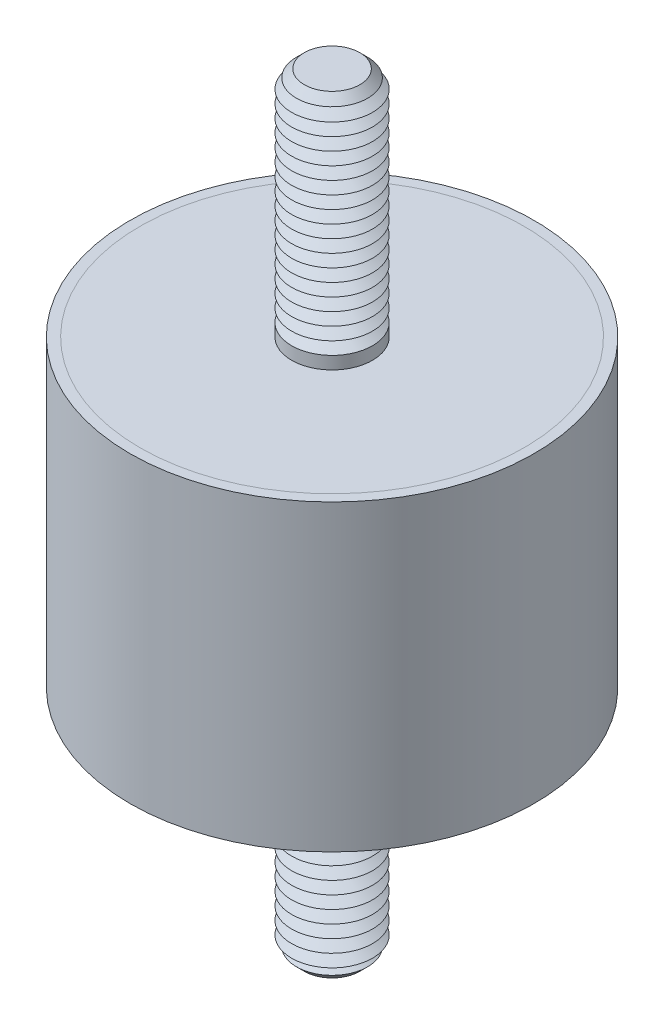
ISO-10303-21;
HEADER;
FILE_DESCRIPTION(('STEP AP214'),'2;1');
FILE_NAME('part.step','',(''),(''),'','','');
FILE_SCHEMA(('AUTOMOTIVE_DESIGN { 1 0 10303 214 1 1 1 1 }'));
ENDSEC;
DATA;
#1=APPLICATION_CONTEXT('core data for automotive mechanical design processes');
#2=APPLICATION_PROTOCOL_DEFINITION('international standard','automotive_design',2000,#1);
#3=PRODUCT_CONTEXT('',#1,'mechanical');
#4=PRODUCT('Part','Part','',(#3));
#5=PRODUCT_RELATED_PRODUCT_CATEGORY('part','',(#4));
#6=PRODUCT_DEFINITION_FORMATION('','',#4);
#7=PRODUCT_DEFINITION_CONTEXT('part definition',#1,'design');
#8=PRODUCT_DEFINITION('design','',#6,#7);
#9=PRODUCT_DEFINITION_SHAPE('','',#8);
#10=(LENGTH_UNIT() NAMED_UNIT(*) SI_UNIT(.MILLI.,.METRE.));
#11=(NAMED_UNIT(*) PLANE_ANGLE_UNIT() SI_UNIT($,.RADIAN.));
#12=(NAMED_UNIT(*) SI_UNIT($,.STERADIAN.) SOLID_ANGLE_UNIT());
#13=UNCERTAINTY_MEASURE_WITH_UNIT(LENGTH_MEASURE(1.E-05),#10,'distance_accuracy_value','');
#14=(GEOMETRIC_REPRESENTATION_CONTEXT(3) GLOBAL_UNCERTAINTY_ASSIGNED_CONTEXT((#13)) GLOBAL_UNIT_ASSIGNED_CONTEXT((#10,
#11,#12)) REPRESENTATION_CONTEXT('',''));
#15=CARTESIAN_POINT('',(0.,0.,0.));
#16=DIRECTION('',(0.,0.,1.));
#17=DIRECTION('',(1.,0.,0.));
#18=AXIS2_PLACEMENT_3D('',#15,#16,#17);
#19=CARTESIAN_POINT('',(0.,-38.,0.));
#20=DIRECTION('',(0.,1.,0.));
#21=DIRECTION('',(0.,0.,1.));
#22=AXIS2_PLACEMENT_3D('',#19,#20,#21);
#23=CYLINDRICAL_SURFACE('',#22,4.);
#24=CARTESIAN_POINT('',(0.,-15.,0.));
#25=DIRECTION('',(0.,-1.,0.));
#26=DIRECTION('',(0.,0.,-1.));
#27=AXIS2_PLACEMENT_3D('',#24,#25,#26);
#28=CIRCLE('',#27,4.);
#29=CARTESIAN_POINT('',(0.,-15.,-4.));
#30=VERTEX_POINT('',#29);
#31=EDGE_CURVE('P0_E22',#30,#30,#28,.T.);
#32=ORIENTED_EDGE('',*,*,#31,.T.);
#33=EDGE_LOOP('',(#32));
#34=FACE_BOUND('',#33,.T.);
#35=CARTESIAN_POINT('',(0.,-16.25,0.));
#36=DIRECTION('',(0.,1.,0.));
#37=DIRECTION('',(0.,0.,1.));
#38=AXIS2_PLACEMENT_3D('',#35,#36,#37);
#39=CIRCLE('',#38,4.);
#40=CARTESIAN_POINT('',(0.,-16.25,4.));
#41=VERTEX_POINT('',#40);
#42=EDGE_CURVE('P0_E32',#41,#41,#39,.T.);
#43=ORIENTED_EDGE('',*,*,#42,.T.);
#44=EDGE_LOOP('',(#43));
#45=FACE_BOUND('',#44,.T.);
#46=ADVANCED_FACE('P0_F14',(#34,#45),#23,.T.);
#47=CARTESIAN_POINT('',(0.,-15.,0.));
#48=DIRECTION('',(0.,1.,0.));
#49=DIRECTION('',(0.,0.,1.));
#50=AXIS2_PLACEMENT_3D('',#47,#48,#49);
#51=CYLINDRICAL_SURFACE('',#50,19.);
#52=CARTESIAN_POINT('',(0.,-15.,0.));
#53=DIRECTION('',(0.,1.,0.));
#54=DIRECTION('',(0.,0.,1.));
#55=AXIS2_PLACEMENT_3D('',#52,#53,#54);
#56=CIRCLE('',#55,19.);
#57=CARTESIAN_POINT('',(0.,-15.,19.));
#58=VERTEX_POINT('',#57);
#59=EDGE_CURVE('P0_E26',#58,#58,#56,.T.);
#60=ORIENTED_EDGE('',*,*,#59,.T.);
#61=EDGE_LOOP('',(#60));
#62=FACE_BOUND('',#61,.T.);
#63=CARTESIAN_POINT('',(0.,-14.,0.));
#64=DIRECTION('',(0.,1.,0.));
#65=DIRECTION('',(0.,0.,1.));
#66=AXIS2_PLACEMENT_3D('',#63,#64,#65);
#67=CIRCLE('',#66,19.);
#68=CARTESIAN_POINT('',(0.,-14.,19.));
#69=VERTEX_POINT('',#68);
#70=EDGE_CURVE('P0_E29',#69,#69,#67,.T.);
#71=ORIENTED_EDGE('',*,*,#70,.F.);
#72=EDGE_LOOP('',(#71));
#73=FACE_BOUND('',#72,.T.);
#74=ADVANCED_FACE('P0_F155',(#62,#73),#51,.T.);
#75=CARTESIAN_POINT('',(0.,-15.,0.));
#76=DIRECTION('',(0.,1.,0.));
#77=DIRECTION('',(0.,0.,1.));
#78=AXIS2_PLACEMENT_3D('',#75,#76,#77);
#79=PLANE('',#78);
#80=ORIENTED_EDGE('',*,*,#31,.F.);
#81=EDGE_LOOP('',(#80));
#82=FACE_BOUND('',#81,.T.);
#83=ORIENTED_EDGE('',*,*,#59,.F.);
#84=EDGE_LOOP('',(#83));
#85=FACE_BOUND('',#84,.T.);
#86=ADVANCED_FACE('P0_F161',(#82,#85),#79,.F.);
#87=CARTESIAN_POINT('',(0.,-14.,0.));
#88=DIRECTION('',(0.,1.,0.));
#89=DIRECTION('',(0.,0.,1.));
#90=AXIS2_PLACEMENT_3D('',#87,#88,#89);
#91=PLANE('',#90);
#92=ORIENTED_EDGE('',*,*,#70,.T.);
#93=EDGE_LOOP('',(#92));
#94=FACE_BOUND('',#93,.T.);
#95=ADVANCED_FACE('P0_F168',(#94),#91,.T.);
#96=CARTESIAN_POINT('',(0.,-16.25,0.));
#97=DIRECTION('',(0.,1.,0.));
#98=DIRECTION('',(0.,0.,1.));
#99=AXIS2_PLACEMENT_3D('',#96,#97,#98);
#100=CONICAL_SURFACE('',#99,4.,1.0471975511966);
#101=CARTESIAN_POINT('',(0.,-16.875,0.));
#102=DIRECTION('',(0.,1.,0.));
#103=DIRECTION('',(0.,0.,1.));
#104=AXIS2_PLACEMENT_3D('',#101,#102,#103);
#105=CIRCLE('',#104,2.91746824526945);
#106=CARTESIAN_POINT('',(0.,-16.875,2.91746824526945));
#107=VERTEX_POINT('',#106);
#108=EDGE_CURVE('P0_E37',#107,#107,#105,.T.);
#109=ORIENTED_EDGE('',*,*,#108,.T.);
#110=EDGE_LOOP('',(#109));
#111=FACE_BOUND('',#110,.T.);
#112=ORIENTED_EDGE('',*,*,#42,.F.);
#113=EDGE_LOOP('',(#112));
#114=FACE_BOUND('',#113,.T.);
#115=ADVANCED_FACE('P0_F171',(#111,#114),#100,.T.);
#116=CARTESIAN_POINT('',(0.,-16.875,0.));
#117=DIRECTION('',(0.,-1.,0.));
#118=DIRECTION('',(0.,0.,-1.));
#119=AXIS2_PLACEMENT_3D('',#116,#117,#118);
#120=CONICAL_SURFACE('',#119,2.91746824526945,1.0471975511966);
#121=CARTESIAN_POINT('',(0.,-17.5,0.));
#122=DIRECTION('',(0.,1.,0.));
#123=DIRECTION('',(0.,0.,1.));
#124=AXIS2_PLACEMENT_3D('',#121,#122,#123);
#125=CIRCLE('',#124,4.);
#126=CARTESIAN_POINT('',(0.,-17.5,4.));
#127=VERTEX_POINT('',#126);
#128=EDGE_CURVE('P0_E40',#127,#127,#125,.T.);
#129=ORIENTED_EDGE('',*,*,#128,.T.);
#130=EDGE_LOOP('',(#129));
#131=FACE_BOUND('',#130,.T.);
#132=ORIENTED_EDGE('',*,*,#108,.F.);
#133=EDGE_LOOP('',(#132));
#134=FACE_BOUND('',#133,.T.);
#135=ADVANCED_FACE('P0_F176',(#131,#134),#120,.T.);
#136=CARTESIAN_POINT('',(0.,-17.5,0.));
#137=DIRECTION('',(0.,1.,0.));
#138=DIRECTION('',(0.,0.,1.));
#139=AXIS2_PLACEMENT_3D('',#136,#137,#138);
#140=CONICAL_SURFACE('',#139,4.,1.0471975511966);
#141=CARTESIAN_POINT('',(0.,-18.125,0.));
#142=DIRECTION('',(0.,1.,0.));
#143=DIRECTION('',(0.,0.,1.));
#144=AXIS2_PLACEMENT_3D('',#141,#142,#143);
#145=CIRCLE('',#144,2.91746824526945);
#146=CARTESIAN_POINT('',(0.,-18.125,2.91746824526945));
#147=VERTEX_POINT('',#146);
#148=EDGE_CURVE('P0_E43',#147,#147,#145,.T.);
#149=ORIENTED_EDGE('',*,*,#148,.T.);
#150=EDGE_LOOP('',(#149));
#151=FACE_BOUND('',#150,.T.);
#152=ORIENTED_EDGE('',*,*,#128,.F.);
#153=EDGE_LOOP('',(#152));
#154=FACE_BOUND('',#153,.T.);
#155=ADVANCED_FACE('P0_F183',(#151,#154),#140,.T.);
#156=CARTESIAN_POINT('',(0.,-18.125,0.));
#157=DIRECTION('',(0.,-1.,0.));
#158=DIRECTION('',(0.,0.,-1.));
#159=AXIS2_PLACEMENT_3D('',#156,#157,#158);
#160=CONICAL_SURFACE('',#159,2.91746824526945,1.0471975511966);
#161=CARTESIAN_POINT('',(0.,-18.75,0.));
#162=DIRECTION('',(0.,1.,0.));
#163=DIRECTION('',(0.,0.,1.));
#164=AXIS2_PLACEMENT_3D('',#161,#162,#163);
#165=CIRCLE('',#164,4.);
#166=CARTESIAN_POINT('',(0.,-18.75,4.));
#167=VERTEX_POINT('',#166);
#168=EDGE_CURVE('P0_E46',#167,#167,#165,.T.);
#169=ORIENTED_EDGE('',*,*,#168,.T.);
#170=EDGE_LOOP('',(#169));
#171=FACE_BOUND('',#170,.T.);
#172=ORIENTED_EDGE('',*,*,#148,.F.);
#173=EDGE_LOOP('',(#172));
#174=FACE_BOUND('',#173,.T.);
#175=ADVANCED_FACE('P0_F190',(#171,#174),#160,.T.);
#176=CARTESIAN_POINT('',(0.,-18.75,0.));
#177=DIRECTION('',(0.,1.,0.));
#178=DIRECTION('',(0.,0.,1.));
#179=AXIS2_PLACEMENT_3D('',#176,#177,#178);
#180=CONICAL_SURFACE('',#179,4.,1.0471975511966);
#181=CARTESIAN_POINT('',(0.,-19.375,0.));
#182=DIRECTION('',(0.,1.,0.));
#183=DIRECTION('',(0.,0.,1.));
#184=AXIS2_PLACEMENT_3D('',#181,#182,#183);
#185=CIRCLE('',#184,2.91746824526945);
#186=CARTESIAN_POINT('',(0.,-19.375,2.91746824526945));
#187=VERTEX_POINT('',#186);
#188=EDGE_CURVE('P0_E49',#187,#187,#185,.T.);
#189=ORIENTED_EDGE('',*,*,#188,.T.);
#190=EDGE_LOOP('',(#189));
#191=FACE_BOUND('',#190,.T.);
#192=ORIENTED_EDGE('',*,*,#168,.F.);
#193=EDGE_LOOP('',(#192));
#194=FACE_BOUND('',#193,.T.);
#195=ADVANCED_FACE('P0_F194',(#191,#194),#180,.T.);
#196=CARTESIAN_POINT('',(0.,-19.375,0.));
#197=DIRECTION('',(0.,-1.,0.));
#198=DIRECTION('',(0.,0.,-1.));
#199=AXIS2_PLACEMENT_3D('',#196,#197,#198);
#200=CONICAL_SURFACE('',#199,2.91746824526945,1.0471975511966);
#201=CARTESIAN_POINT('',(0.,-20.,0.));
#202=DIRECTION('',(0.,1.,0.));
#203=DIRECTION('',(0.,0.,1.));
#204=AXIS2_PLACEMENT_3D('',#201,#202,#203);
#205=CIRCLE('',#204,4.);
#206=CARTESIAN_POINT('',(0.,-20.,4.));
#207=VERTEX_POINT('',#206);
#208=EDGE_CURVE('P0_E52',#207,#207,#205,.T.);
#209=ORIENTED_EDGE('',*,*,#208,.T.);
#210=EDGE_LOOP('',(#209));
#211=FACE_BOUND('',#210,.T.);
#212=ORIENTED_EDGE('',*,*,#188,.F.);
#213=EDGE_LOOP('',(#212));
#214=FACE_BOUND('',#213,.T.);
#215=ADVANCED_FACE('P0_F198',(#211,#214),#200,.T.);
#216=CARTESIAN_POINT('',(0.,-20.,0.));
#217=DIRECTION('',(0.,1.,0.));
#218=DIRECTION('',(0.,0.,1.));
#219=AXIS2_PLACEMENT_3D('',#216,#217,#218);
#220=CONICAL_SURFACE('',#219,4.,1.0471975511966);
#221=CARTESIAN_POINT('',(0.,-20.625,0.));
#222=DIRECTION('',(0.,1.,0.));
#223=DIRECTION('',(0.,0.,1.));
#224=AXIS2_PLACEMENT_3D('',#221,#222,#223);
#225=CIRCLE('',#224,2.91746824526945);
#226=CARTESIAN_POINT('',(0.,-20.625,2.91746824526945));
#227=VERTEX_POINT('',#226);
#228=EDGE_CURVE('P0_E55',#227,#227,#225,.T.);
#229=ORIENTED_EDGE('',*,*,#228,.T.);
#230=EDGE_LOOP('',(#229));
#231=FACE_BOUND('',#230,.T.);
#232=ORIENTED_EDGE('',*,*,#208,.F.);
#233=EDGE_LOOP('',(#232));
#234=FACE_BOUND('',#233,.T.);
#235=ADVANCED_FACE('P0_F202',(#231,#234),#220,.T.);
#236=CARTESIAN_POINT('',(0.,-20.625,0.));
#237=DIRECTION('',(0.,-1.,0.));
#238=DIRECTION('',(0.,0.,-1.));
#239=AXIS2_PLACEMENT_3D('',#236,#237,#238);
#240=CONICAL_SURFACE('',#239,2.91746824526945,1.0471975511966);
#241=CARTESIAN_POINT('',(0.,-21.25,0.));
#242=DIRECTION('',(0.,1.,0.));
#243=DIRECTION('',(0.,0.,1.));
#244=AXIS2_PLACEMENT_3D('',#241,#242,#243);
#245=CIRCLE('',#244,4.);
#246=CARTESIAN_POINT('',(0.,-21.25,4.));
#247=VERTEX_POINT('',#246);
#248=EDGE_CURVE('P0_E58',#247,#247,#245,.T.);
#249=ORIENTED_EDGE('',*,*,#248,.T.);
#250=EDGE_LOOP('',(#249));
#251=FACE_BOUND('',#250,.T.);
#252=ORIENTED_EDGE('',*,*,#228,.F.);
#253=EDGE_LOOP('',(#252));
#254=FACE_BOUND('',#253,.T.);
#255=ADVANCED_FACE('P0_F206',(#251,#254),#240,.T.);
#256=CARTESIAN_POINT('',(0.,-21.25,0.));
#257=DIRECTION('',(0.,1.,0.));
#258=DIRECTION('',(0.,0.,1.));
#259=AXIS2_PLACEMENT_3D('',#256,#257,#258);
#260=CONICAL_SURFACE('',#259,4.,1.0471975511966);
#261=CARTESIAN_POINT('',(0.,-21.875,0.));
#262=DIRECTION('',(0.,1.,0.));
#263=DIRECTION('',(0.,0.,1.));
#264=AXIS2_PLACEMENT_3D('',#261,#262,#263);
#265=CIRCLE('',#264,2.91746824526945);
#266=CARTESIAN_POINT('',(0.,-21.875,2.91746824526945));
#267=VERTEX_POINT('',#266);
#268=EDGE_CURVE('P0_E61',#267,#267,#265,.T.);
#269=ORIENTED_EDGE('',*,*,#268,.T.);
#270=EDGE_LOOP('',(#269));
#271=FACE_BOUND('',#270,.T.);
#272=ORIENTED_EDGE('',*,*,#248,.F.);
#273=EDGE_LOOP('',(#272));
#274=FACE_BOUND('',#273,.T.);
#275=ADVANCED_FACE('P0_F210',(#271,#274),#260,.T.);
#276=CARTESIAN_POINT('',(0.,-21.875,0.));
#277=DIRECTION('',(0.,-1.,0.));
#278=DIRECTION('',(0.,0.,-1.));
#279=AXIS2_PLACEMENT_3D('',#276,#277,#278);
#280=CONICAL_SURFACE('',#279,2.91746824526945,1.0471975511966);
#281=CARTESIAN_POINT('',(0.,-22.5,0.));
#282=DIRECTION('',(0.,1.,0.));
#283=DIRECTION('',(0.,0.,1.));
#284=AXIS2_PLACEMENT_3D('',#281,#282,#283);
#285=CIRCLE('',#284,4.);
#286=CARTESIAN_POINT('',(0.,-22.5,4.));
#287=VERTEX_POINT('',#286);
#288=EDGE_CURVE('P0_E64',#287,#287,#285,.T.);
#289=ORIENTED_EDGE('',*,*,#288,.T.);
#290=EDGE_LOOP('',(#289));
#291=FACE_BOUND('',#290,.T.);
#292=ORIENTED_EDGE('',*,*,#268,.F.);
#293=EDGE_LOOP('',(#292));
#294=FACE_BOUND('',#293,.T.);
#295=ADVANCED_FACE('P0_F214',(#291,#294),#280,.T.);
#296=CARTESIAN_POINT('',(0.,-22.5,0.));
#297=DIRECTION('',(0.,1.,0.));
#298=DIRECTION('',(0.,0.,1.));
#299=AXIS2_PLACEMENT_3D('',#296,#297,#298);
#300=CONICAL_SURFACE('',#299,4.,1.0471975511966);
#301=CARTESIAN_POINT('',(0.,-23.125,0.));
#302=DIRECTION('',(0.,1.,0.));
#303=DIRECTION('',(0.,0.,1.));
#304=AXIS2_PLACEMENT_3D('',#301,#302,#303);
#305=CIRCLE('',#304,2.91746824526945);
#306=CARTESIAN_POINT('',(0.,-23.125,2.91746824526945));
#307=VERTEX_POINT('',#306);
#308=EDGE_CURVE('P0_E67',#307,#307,#305,.T.);
#309=ORIENTED_EDGE('',*,*,#308,.T.);
#310=EDGE_LOOP('',(#309));
#311=FACE_BOUND('',#310,.T.);
#312=ORIENTED_EDGE('',*,*,#288,.F.);
#313=EDGE_LOOP('',(#312));
#314=FACE_BOUND('',#313,.T.);
#315=ADVANCED_FACE('P0_F218',(#311,#314),#300,.T.);
#316=CARTESIAN_POINT('',(0.,-23.125,0.));
#317=DIRECTION('',(0.,-1.,0.));
#318=DIRECTION('',(0.,0.,-1.));
#319=AXIS2_PLACEMENT_3D('',#316,#317,#318);
#320=CONICAL_SURFACE('',#319,2.91746824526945,1.0471975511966);
#321=CARTESIAN_POINT('',(0.,-23.75,0.));
#322=DIRECTION('',(0.,1.,0.));
#323=DIRECTION('',(0.,0.,1.));
#324=AXIS2_PLACEMENT_3D('',#321,#322,#323);
#325=CIRCLE('',#324,4.);
#326=CARTESIAN_POINT('',(0.,-23.75,4.));
#327=VERTEX_POINT('',#326);
#328=EDGE_CURVE('P0_E70',#327,#327,#325,.T.);
#329=ORIENTED_EDGE('',*,*,#328,.T.);
#330=EDGE_LOOP('',(#329));
#331=FACE_BOUND('',#330,.T.);
#332=ORIENTED_EDGE('',*,*,#308,.F.);
#333=EDGE_LOOP('',(#332));
#334=FACE_BOUND('',#333,.T.);
#335=ADVANCED_FACE('P0_F222',(#331,#334),#320,.T.);
#336=CARTESIAN_POINT('',(0.,-23.75,0.));
#337=DIRECTION('',(0.,1.,0.));
#338=DIRECTION('',(0.,0.,1.));
#339=AXIS2_PLACEMENT_3D('',#336,#337,#338);
#340=CONICAL_SURFACE('',#339,4.,1.0471975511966);
#341=CARTESIAN_POINT('',(0.,-24.375,0.));
#342=DIRECTION('',(0.,1.,0.));
#343=DIRECTION('',(0.,0.,1.));
#344=AXIS2_PLACEMENT_3D('',#341,#342,#343);
#345=CIRCLE('',#344,2.91746824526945);
#346=CARTESIAN_POINT('',(0.,-24.375,2.91746824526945));
#347=VERTEX_POINT('',#346);
#348=EDGE_CURVE('P0_E73',#347,#347,#345,.T.);
#349=ORIENTED_EDGE('',*,*,#348,.T.);
#350=EDGE_LOOP('',(#349));
#351=FACE_BOUND('',#350,.T.);
#352=ORIENTED_EDGE('',*,*,#328,.F.);
#353=EDGE_LOOP('',(#352));
#354=FACE_BOUND('',#353,.T.);
#355=ADVANCED_FACE('P0_F226',(#351,#354),#340,.T.);
#356=CARTESIAN_POINT('',(0.,-24.375,0.));
#357=DIRECTION('',(0.,-1.,0.));
#358=DIRECTION('',(0.,0.,-1.));
#359=AXIS2_PLACEMENT_3D('',#356,#357,#358);
#360=CONICAL_SURFACE('',#359,2.91746824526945,1.0471975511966);
#361=CARTESIAN_POINT('',(0.,-25.,0.));
#362=DIRECTION('',(0.,1.,0.));
#363=DIRECTION('',(0.,0.,1.));
#364=AXIS2_PLACEMENT_3D('',#361,#362,#363);
#365=CIRCLE('',#364,4.);
#366=CARTESIAN_POINT('',(0.,-25.,4.));
#367=VERTEX_POINT('',#366);
#368=EDGE_CURVE('P0_E76',#367,#367,#365,.T.);
#369=ORIENTED_EDGE('',*,*,#368,.T.);
#370=EDGE_LOOP('',(#369));
#371=FACE_BOUND('',#370,.T.);
#372=ORIENTED_EDGE('',*,*,#348,.F.);
#373=EDGE_LOOP('',(#372));
#374=FACE_BOUND('',#373,.T.);
#375=ADVANCED_FACE('P0_F230',(#371,#374),#360,.T.);
#376=CARTESIAN_POINT('',(0.,-25.,0.));
#377=DIRECTION('',(0.,1.,0.));
#378=DIRECTION('',(0.,0.,1.));
#379=AXIS2_PLACEMENT_3D('',#376,#377,#378);
#380=CONICAL_SURFACE('',#379,4.,1.0471975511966);
#381=CARTESIAN_POINT('',(0.,-25.625,0.));
#382=DIRECTION('',(0.,1.,0.));
#383=DIRECTION('',(0.,0.,1.));
#384=AXIS2_PLACEMENT_3D('',#381,#382,#383);
#385=CIRCLE('',#384,2.91746824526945);
#386=CARTESIAN_POINT('',(0.,-25.625,2.91746824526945));
#387=VERTEX_POINT('',#386);
#388=EDGE_CURVE('P0_E79',#387,#387,#385,.T.);
#389=ORIENTED_EDGE('',*,*,#388,.T.);
#390=EDGE_LOOP('',(#389));
#391=FACE_BOUND('',#390,.T.);
#392=ORIENTED_EDGE('',*,*,#368,.F.);
#393=EDGE_LOOP('',(#392));
#394=FACE_BOUND('',#393,.T.);
#395=ADVANCED_FACE('P0_F234',(#391,#394),#380,.T.);
#396=CARTESIAN_POINT('',(0.,-25.625,0.));
#397=DIRECTION('',(0.,-1.,0.));
#398=DIRECTION('',(0.,0.,-1.));
#399=AXIS2_PLACEMENT_3D('',#396,#397,#398);
#400=CONICAL_SURFACE('',#399,2.91746824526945,1.0471975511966);
#401=CARTESIAN_POINT('',(0.,-26.25,0.));
#402=DIRECTION('',(0.,1.,0.));
#403=DIRECTION('',(0.,0.,1.));
#404=AXIS2_PLACEMENT_3D('',#401,#402,#403);
#405=CIRCLE('',#404,4.);
#406=CARTESIAN_POINT('',(0.,-26.25,4.));
#407=VERTEX_POINT('',#406);
#408=EDGE_CURVE('P0_E82',#407,#407,#405,.T.);
#409=ORIENTED_EDGE('',*,*,#408,.T.);
#410=EDGE_LOOP('',(#409));
#411=FACE_BOUND('',#410,.T.);
#412=ORIENTED_EDGE('',*,*,#388,.F.);
#413=EDGE_LOOP('',(#412));
#414=FACE_BOUND('',#413,.T.);
#415=ADVANCED_FACE('P0_F238',(#411,#414),#400,.T.);
#416=CARTESIAN_POINT('',(0.,-26.25,0.));
#417=DIRECTION('',(0.,1.,0.));
#418=DIRECTION('',(0.,0.,1.));
#419=AXIS2_PLACEMENT_3D('',#416,#417,#418);
#420=CONICAL_SURFACE('',#419,4.,1.0471975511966);
#421=CARTESIAN_POINT('',(0.,-26.875,0.));
#422=DIRECTION('',(0.,1.,0.));
#423=DIRECTION('',(0.,0.,1.));
#424=AXIS2_PLACEMENT_3D('',#421,#422,#423);
#425=CIRCLE('',#424,2.91746824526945);
#426=CARTESIAN_POINT('',(0.,-26.875,2.91746824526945));
#427=VERTEX_POINT('',#426);
#428=EDGE_CURVE('P0_E85',#427,#427,#425,.T.);
#429=ORIENTED_EDGE('',*,*,#428,.T.);
#430=EDGE_LOOP('',(#429));
#431=FACE_BOUND('',#430,.T.);
#432=ORIENTED_EDGE('',*,*,#408,.F.);
#433=EDGE_LOOP('',(#432));
#434=FACE_BOUND('',#433,.T.);
#435=ADVANCED_FACE('P0_F242',(#431,#434),#420,.T.);
#436=CARTESIAN_POINT('',(0.,-26.875,0.));
#437=DIRECTION('',(0.,-1.,0.));
#438=DIRECTION('',(0.,0.,-1.));
#439=AXIS2_PLACEMENT_3D('',#436,#437,#438);
#440=CONICAL_SURFACE('',#439,2.91746824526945,1.0471975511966);
#441=CARTESIAN_POINT('',(0.,-27.5,0.));
#442=DIRECTION('',(0.,1.,0.));
#443=DIRECTION('',(0.,0.,1.));
#444=AXIS2_PLACEMENT_3D('',#441,#442,#443);
#445=CIRCLE('',#444,4.);
#446=CARTESIAN_POINT('',(0.,-27.5,4.));
#447=VERTEX_POINT('',#446);
#448=EDGE_CURVE('P0_E88',#447,#447,#445,.T.);
#449=ORIENTED_EDGE('',*,*,#448,.T.);
#450=EDGE_LOOP('',(#449));
#451=FACE_BOUND('',#450,.T.);
#452=ORIENTED_EDGE('',*,*,#428,.F.);
#453=EDGE_LOOP('',(#452));
#454=FACE_BOUND('',#453,.T.);
#455=ADVANCED_FACE('P0_F246',(#451,#454),#440,.T.);
#456=CARTESIAN_POINT('',(0.,-27.5,0.));
#457=DIRECTION('',(0.,1.,0.));
#458=DIRECTION('',(0.,0.,1.));
#459=AXIS2_PLACEMENT_3D('',#456,#457,#458);
#460=CONICAL_SURFACE('',#459,4.,1.0471975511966);
#461=CARTESIAN_POINT('',(0.,-28.125,0.));
#462=DIRECTION('',(0.,1.,0.));
#463=DIRECTION('',(0.,0.,1.));
#464=AXIS2_PLACEMENT_3D('',#461,#462,#463);
#465=CIRCLE('',#464,2.91746824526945);
#466=CARTESIAN_POINT('',(0.,-28.125,2.91746824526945));
#467=VERTEX_POINT('',#466);
#468=EDGE_CURVE('P0_E91',#467,#467,#465,.T.);
#469=ORIENTED_EDGE('',*,*,#468,.T.);
#470=EDGE_LOOP('',(#469));
#471=FACE_BOUND('',#470,.T.);
#472=ORIENTED_EDGE('',*,*,#448,.F.);
#473=EDGE_LOOP('',(#472));
#474=FACE_BOUND('',#473,.T.);
#475=ADVANCED_FACE('P0_F250',(#471,#474),#460,.T.);
#476=CARTESIAN_POINT('',(0.,-28.125,0.));
#477=DIRECTION('',(0.,-1.,0.));
#478=DIRECTION('',(0.,0.,-1.));
#479=AXIS2_PLACEMENT_3D('',#476,#477,#478);
#480=CONICAL_SURFACE('',#479,2.91746824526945,1.0471975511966);
#481=CARTESIAN_POINT('',(0.,-28.75,0.));
#482=DIRECTION('',(0.,1.,0.));
#483=DIRECTION('',(0.,0.,1.));
#484=AXIS2_PLACEMENT_3D('',#481,#482,#483);
#485=CIRCLE('',#484,4.);
#486=CARTESIAN_POINT('',(0.,-28.75,4.));
#487=VERTEX_POINT('',#486);
#488=EDGE_CURVE('P0_E94',#487,#487,#485,.T.);
#489=ORIENTED_EDGE('',*,*,#488,.T.);
#490=EDGE_LOOP('',(#489));
#491=FACE_BOUND('',#490,.T.);
#492=ORIENTED_EDGE('',*,*,#468,.F.);
#493=EDGE_LOOP('',(#492));
#494=FACE_BOUND('',#493,.T.);
#495=ADVANCED_FACE('P0_F254',(#491,#494),#480,.T.);
#496=CARTESIAN_POINT('',(0.,-28.75,0.));
#497=DIRECTION('',(0.,1.,0.));
#498=DIRECTION('',(0.,0.,1.));
#499=AXIS2_PLACEMENT_3D('',#496,#497,#498);
#500=CONICAL_SURFACE('',#499,4.,1.0471975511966);
#501=CARTESIAN_POINT('',(0.,-29.375,0.));
#502=DIRECTION('',(0.,1.,0.));
#503=DIRECTION('',(0.,0.,1.));
#504=AXIS2_PLACEMENT_3D('',#501,#502,#503);
#505=CIRCLE('',#504,2.91746824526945);
#506=CARTESIAN_POINT('',(0.,-29.375,2.91746824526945));
#507=VERTEX_POINT('',#506);
#508=EDGE_CURVE('P0_E97',#507,#507,#505,.T.);
#509=ORIENTED_EDGE('',*,*,#508,.T.);
#510=EDGE_LOOP('',(#509));
#511=FACE_BOUND('',#510,.T.);
#512=ORIENTED_EDGE('',*,*,#488,.F.);
#513=EDGE_LOOP('',(#512));
#514=FACE_BOUND('',#513,.T.);
#515=ADVANCED_FACE('P0_F258',(#511,#514),#500,.T.);
#516=CARTESIAN_POINT('',(0.,-29.375,0.));
#517=DIRECTION('',(0.,-1.,0.));
#518=DIRECTION('',(0.,0.,-1.));
#519=AXIS2_PLACEMENT_3D('',#516,#517,#518);
#520=CONICAL_SURFACE('',#519,2.91746824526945,1.0471975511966);
#521=CARTESIAN_POINT('',(0.,-30.,0.));
#522=DIRECTION('',(0.,1.,0.));
#523=DIRECTION('',(0.,0.,1.));
#524=AXIS2_PLACEMENT_3D('',#521,#522,#523);
#525=CIRCLE('',#524,4.);
#526=CARTESIAN_POINT('',(0.,-30.,4.));
#527=VERTEX_POINT('',#526);
#528=EDGE_CURVE('P0_E100',#527,#527,#525,.T.);
#529=ORIENTED_EDGE('',*,*,#528,.T.);
#530=EDGE_LOOP('',(#529));
#531=FACE_BOUND('',#530,.T.);
#532=ORIENTED_EDGE('',*,*,#508,.F.);
#533=EDGE_LOOP('',(#532));
#534=FACE_BOUND('',#533,.T.);
#535=ADVANCED_FACE('P0_F262',(#531,#534),#520,.T.);
#536=CARTESIAN_POINT('',(0.,-30.,0.));
#537=DIRECTION('',(0.,1.,0.));
#538=DIRECTION('',(0.,0.,1.));
#539=AXIS2_PLACEMENT_3D('',#536,#537,#538);
#540=CONICAL_SURFACE('',#539,4.,1.0471975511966);
#541=CARTESIAN_POINT('',(0.,-30.625,0.));
#542=DIRECTION('',(0.,1.,0.));
#543=DIRECTION('',(0.,0.,1.));
#544=AXIS2_PLACEMENT_3D('',#541,#542,#543);
#545=CIRCLE('',#544,2.91746824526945);
#546=CARTESIAN_POINT('',(0.,-30.625,2.91746824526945));
#547=VERTEX_POINT('',#546);
#548=EDGE_CURVE('P0_E103',#547,#547,#545,.T.);
#549=ORIENTED_EDGE('',*,*,#548,.T.);
#550=EDGE_LOOP('',(#549));
#551=FACE_BOUND('',#550,.T.);
#552=ORIENTED_EDGE('',*,*,#528,.F.);
#553=EDGE_LOOP('',(#552));
#554=FACE_BOUND('',#553,.T.);
#555=ADVANCED_FACE('P0_F266',(#551,#554),#540,.T.);
#556=CARTESIAN_POINT('',(0.,-30.625,0.));
#557=DIRECTION('',(0.,-1.,0.));
#558=DIRECTION('',(0.,0.,-1.));
#559=AXIS2_PLACEMENT_3D('',#556,#557,#558);
#560=CONICAL_SURFACE('',#559,2.91746824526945,1.0471975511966);
#561=CARTESIAN_POINT('',(0.,-31.25,0.));
#562=DIRECTION('',(0.,1.,0.));
#563=DIRECTION('',(0.,0.,1.));
#564=AXIS2_PLACEMENT_3D('',#561,#562,#563);
#565=CIRCLE('',#564,4.);
#566=CARTESIAN_POINT('',(0.,-31.25,4.));
#567=VERTEX_POINT('',#566);
#568=EDGE_CURVE('P0_E106',#567,#567,#565,.T.);
#569=ORIENTED_EDGE('',*,*,#568,.T.);
#570=EDGE_LOOP('',(#569));
#571=FACE_BOUND('',#570,.T.);
#572=ORIENTED_EDGE('',*,*,#548,.F.);
#573=EDGE_LOOP('',(#572));
#574=FACE_BOUND('',#573,.T.);
#575=ADVANCED_FACE('P0_F270',(#571,#574),#560,.T.);
#576=CARTESIAN_POINT('',(0.,-31.25,0.));
#577=DIRECTION('',(0.,1.,0.));
#578=DIRECTION('',(0.,0.,1.));
#579=AXIS2_PLACEMENT_3D('',#576,#577,#578);
#580=CONICAL_SURFACE('',#579,4.,1.0471975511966);
#581=CARTESIAN_POINT('',(0.,-31.875,0.));
#582=DIRECTION('',(0.,1.,0.));
#583=DIRECTION('',(0.,0.,1.));
#584=AXIS2_PLACEMENT_3D('',#581,#582,#583);
#585=CIRCLE('',#584,2.91746824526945);
#586=CARTESIAN_POINT('',(0.,-31.875,2.91746824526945));
#587=VERTEX_POINT('',#586);
#588=EDGE_CURVE('P0_E109',#587,#587,#585,.T.);
#589=ORIENTED_EDGE('',*,*,#588,.T.);
#590=EDGE_LOOP('',(#589));
#591=FACE_BOUND('',#590,.T.);
#592=ORIENTED_EDGE('',*,*,#568,.F.);
#593=EDGE_LOOP('',(#592));
#594=FACE_BOUND('',#593,.T.);
#595=ADVANCED_FACE('P0_F274',(#591,#594),#580,.T.);
#596=CARTESIAN_POINT('',(0.,-31.875,0.));
#597=DIRECTION('',(0.,-1.,0.));
#598=DIRECTION('',(0.,0.,-1.));
#599=AXIS2_PLACEMENT_3D('',#596,#597,#598);
#600=CONICAL_SURFACE('',#599,2.91746824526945,1.0471975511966);
#601=CARTESIAN_POINT('',(0.,-32.5,0.));
#602=DIRECTION('',(0.,1.,0.));
#603=DIRECTION('',(0.,0.,1.));
#604=AXIS2_PLACEMENT_3D('',#601,#602,#603);
#605=CIRCLE('',#604,4.);
#606=CARTESIAN_POINT('',(0.,-32.5,4.));
#607=VERTEX_POINT('',#606);
#608=EDGE_CURVE('P0_E112',#607,#607,#605,.T.);
#609=ORIENTED_EDGE('',*,*,#608,.T.);
#610=EDGE_LOOP('',(#609));
#611=FACE_BOUND('',#610,.T.);
#612=ORIENTED_EDGE('',*,*,#588,.F.);
#613=EDGE_LOOP('',(#612));
#614=FACE_BOUND('',#613,.T.);
#615=ADVANCED_FACE('P0_F278',(#611,#614),#600,.T.);
#616=CARTESIAN_POINT('',(0.,-32.5,0.));
#617=DIRECTION('',(0.,1.,0.));
#618=DIRECTION('',(0.,0.,1.));
#619=AXIS2_PLACEMENT_3D('',#616,#617,#618);
#620=CONICAL_SURFACE('',#619,4.,1.0471975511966);
#621=CARTESIAN_POINT('',(0.,-33.125,0.));
#622=DIRECTION('',(0.,1.,0.));
#623=DIRECTION('',(0.,0.,1.));
#624=AXIS2_PLACEMENT_3D('',#621,#622,#623);
#625=CIRCLE('',#624,2.91746824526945);
#626=CARTESIAN_POINT('',(0.,-33.125,2.91746824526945));
#627=VERTEX_POINT('',#626);
#628=EDGE_CURVE('P0_E115',#627,#627,#625,.T.);
#629=ORIENTED_EDGE('',*,*,#628,.T.);
#630=EDGE_LOOP('',(#629));
#631=FACE_BOUND('',#630,.T.);
#632=ORIENTED_EDGE('',*,*,#608,.F.);
#633=EDGE_LOOP('',(#632));
#634=FACE_BOUND('',#633,.T.);
#635=ADVANCED_FACE('P0_F282',(#631,#634),#620,.T.);
#636=CARTESIAN_POINT('',(0.,-33.125,0.));
#637=DIRECTION('',(0.,-1.,0.));
#638=DIRECTION('',(0.,0.,-1.));
#639=AXIS2_PLACEMENT_3D('',#636,#637,#638);
#640=CONICAL_SURFACE('',#639,2.91746824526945,1.0471975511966);
#641=CARTESIAN_POINT('',(0.,-33.75,0.));
#642=DIRECTION('',(0.,1.,0.));
#643=DIRECTION('',(0.,0.,1.));
#644=AXIS2_PLACEMENT_3D('',#641,#642,#643);
#645=CIRCLE('',#644,4.);
#646=CARTESIAN_POINT('',(0.,-33.75,4.));
#647=VERTEX_POINT('',#646);
#648=EDGE_CURVE('P0_E118',#647,#647,#645,.T.);
#649=ORIENTED_EDGE('',*,*,#648,.T.);
#650=EDGE_LOOP('',(#649));
#651=FACE_BOUND('',#650,.T.);
#652=ORIENTED_EDGE('',*,*,#628,.F.);
#653=EDGE_LOOP('',(#652));
#654=FACE_BOUND('',#653,.T.);
#655=ADVANCED_FACE('P0_F286',(#651,#654),#640,.T.);
#656=CARTESIAN_POINT('',(0.,-33.75,0.));
#657=DIRECTION('',(0.,1.,0.));
#658=DIRECTION('',(0.,0.,1.));
#659=AXIS2_PLACEMENT_3D('',#656,#657,#658);
#660=CONICAL_SURFACE('',#659,4.,1.0471975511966);
#661=CARTESIAN_POINT('',(0.,-34.375,0.));
#662=DIRECTION('',(0.,1.,0.));
#663=DIRECTION('',(0.,0.,1.));
#664=AXIS2_PLACEMENT_3D('',#661,#662,#663);
#665=CIRCLE('',#664,2.91746824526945);
#666=CARTESIAN_POINT('',(0.,-34.375,2.91746824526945));
#667=VERTEX_POINT('',#666);
#668=EDGE_CURVE('P0_E121',#667,#667,#665,.T.);
#669=ORIENTED_EDGE('',*,*,#668,.T.);
#670=EDGE_LOOP('',(#669));
#671=FACE_BOUND('',#670,.T.);
#672=ORIENTED_EDGE('',*,*,#648,.F.);
#673=EDGE_LOOP('',(#672));
#674=FACE_BOUND('',#673,.T.);
#675=ADVANCED_FACE('P0_F290',(#671,#674),#660,.T.);
#676=CARTESIAN_POINT('',(0.,-34.375,0.));
#677=DIRECTION('',(0.,-1.,0.));
#678=DIRECTION('',(0.,0.,-1.));
#679=AXIS2_PLACEMENT_3D('',#676,#677,#678);
#680=CONICAL_SURFACE('',#679,2.91746824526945,1.0471975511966);
#681=CARTESIAN_POINT('',(0.,-35.,0.));
#682=DIRECTION('',(0.,1.,0.));
#683=DIRECTION('',(0.,0.,1.));
#684=AXIS2_PLACEMENT_3D('',#681,#682,#683);
#685=CIRCLE('',#684,4.);
#686=CARTESIAN_POINT('',(0.,-35.,4.));
#687=VERTEX_POINT('',#686);
#688=EDGE_CURVE('P0_E124',#687,#687,#685,.T.);
#689=ORIENTED_EDGE('',*,*,#688,.T.);
#690=EDGE_LOOP('',(#689));
#691=FACE_BOUND('',#690,.T.);
#692=ORIENTED_EDGE('',*,*,#668,.F.);
#693=EDGE_LOOP('',(#692));
#694=FACE_BOUND('',#693,.T.);
#695=ADVANCED_FACE('P0_F294',(#691,#694),#680,.T.);
#696=CARTESIAN_POINT('',(0.,-35.,0.));
#697=DIRECTION('',(0.,1.,0.));
#698=DIRECTION('',(0.,0.,1.));
#699=AXIS2_PLACEMENT_3D('',#696,#697,#698);
#700=CONICAL_SURFACE('',#699,4.,1.0471975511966);
#701=CARTESIAN_POINT('',(0.,-35.625,0.));
#702=DIRECTION('',(0.,1.,0.));
#703=DIRECTION('',(0.,0.,1.));
#704=AXIS2_PLACEMENT_3D('',#701,#702,#703);
#705=CIRCLE('',#704,2.91746824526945);
#706=CARTESIAN_POINT('',(0.,-35.625,2.91746824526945));
#707=VERTEX_POINT('',#706);
#708=EDGE_CURVE('P0_E127',#707,#707,#705,.T.);
#709=ORIENTED_EDGE('',*,*,#708,.T.);
#710=EDGE_LOOP('',(#709));
#711=FACE_BOUND('',#710,.T.);
#712=ORIENTED_EDGE('',*,*,#688,.F.);
#713=EDGE_LOOP('',(#712));
#714=FACE_BOUND('',#713,.T.);
#715=ADVANCED_FACE('P0_F298',(#711,#714),#700,.T.);
#716=CARTESIAN_POINT('',(0.,-35.625,0.));
#717=DIRECTION('',(0.,-1.,0.));
#718=DIRECTION('',(0.,0.,-1.));
#719=AXIS2_PLACEMENT_3D('',#716,#717,#718);
#720=CONICAL_SURFACE('',#719,2.91746824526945,1.0471975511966);
#721=CARTESIAN_POINT('',(0.,-36.25,0.));
#722=DIRECTION('',(0.,1.,0.));
#723=DIRECTION('',(0.,0.,1.));
#724=AXIS2_PLACEMENT_3D('',#721,#722,#723);
#725=CIRCLE('',#724,4.);
#726=CARTESIAN_POINT('',(0.,-36.25,4.));
#727=VERTEX_POINT('',#726);
#728=EDGE_CURVE('P0_E130',#727,#727,#725,.T.);
#729=ORIENTED_EDGE('',*,*,#728,.T.);
#730=EDGE_LOOP('',(#729));
#731=FACE_BOUND('',#730,.T.);
#732=ORIENTED_EDGE('',*,*,#708,.F.);
#733=EDGE_LOOP('',(#732));
#734=FACE_BOUND('',#733,.T.);
#735=ADVANCED_FACE('P0_F151',(#731,#734),#720,.T.);
#736=CARTESIAN_POINT('',(0.,-36.25,0.));
#737=DIRECTION('',(0.,1.,0.));
#738=DIRECTION('',(0.,0.,1.));
#739=AXIS2_PLACEMENT_3D('',#736,#737,#738);
#740=CONICAL_SURFACE('',#739,4.,1.0471975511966);
#741=CARTESIAN_POINT('',(0.,-36.875,0.));
#742=DIRECTION('',(0.,1.,0.));
#743=DIRECTION('',(0.,0.,1.));
#744=AXIS2_PLACEMENT_3D('',#741,#742,#743);
#745=CIRCLE('',#744,2.91746824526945);
#746=CARTESIAN_POINT('',(0.,-36.875,2.91746824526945));
#747=VERTEX_POINT('',#746);
#748=EDGE_CURVE('P0_E133',#747,#747,#745,.T.);
#749=ORIENTED_EDGE('',*,*,#748,.T.);
#750=EDGE_LOOP('',(#749));
#751=FACE_BOUND('',#750,.T.);
#752=ORIENTED_EDGE('',*,*,#728,.F.);
#753=EDGE_LOOP('',(#752));
#754=FACE_BOUND('',#753,.T.);
#755=ADVANCED_FACE('P0_F137',(#751,#754),#740,.T.);
#756=CARTESIAN_POINT('',(0.,-36.875,0.));
#757=DIRECTION('',(0.,-1.,0.));
#758=DIRECTION('',(0.,0.,-1.));
#759=AXIS2_PLACEMENT_3D('',#756,#757,#758);
#760=CONICAL_SURFACE('',#759,2.91746824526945,1.0471975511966);
#761=CARTESIAN_POINT('',(0.,-37.2254809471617,0.));
#762=DIRECTION('',(0.,-1.,0.));
#763=DIRECTION('',(0.,0.,-1.));
#764=AXIS2_PLACEMENT_3D('',#761,#762,#763);
#765=CIRCLE('',#764,3.52451905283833);
#766=CARTESIAN_POINT('',(0.,-37.2254809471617,-3.52451905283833));
#767=VERTEX_POINT('',#766);
#768=EDGE_CURVE('P0_E18',#767,#767,#765,.T.);
#769=ORIENTED_EDGE('',*,*,#768,.F.);
#770=EDGE_LOOP('',(#769));
#771=FACE_BOUND('',#770,.T.);
#772=ORIENTED_EDGE('',*,*,#748,.F.);
#773=EDGE_LOOP('',(#772));
#774=FACE_BOUND('',#773,.T.);
#775=ADVANCED_FACE('P0_F140',(#771,#774),#760,.T.);
#776=CARTESIAN_POINT('',(0.,-38.,0.));
#777=DIRECTION('',(0.,-1.,0.));
#778=DIRECTION('',(0.,0.,-1.));
#779=AXIS2_PLACEMENT_3D('',#776,#777,#778);
#780=PLANE('',#779);
#781=CARTESIAN_POINT('',(0.,-38.,0.));
#782=DIRECTION('',(0.,-1.,0.));
#783=DIRECTION('',(0.,0.,-1.));
#784=AXIS2_PLACEMENT_3D('',#781,#782,#783);
#785=CIRCLE('',#784,2.75);
#786=CARTESIAN_POINT('',(0.,-38.,-2.75));
#787=VERTEX_POINT('',#786);
#788=EDGE_CURVE('P0_E10',#787,#787,#785,.T.);
#789=ORIENTED_EDGE('',*,*,#788,.T.);
#790=EDGE_LOOP('',(#789));
#791=FACE_BOUND('',#790,.T.);
#792=ADVANCED_FACE('P0_F142',(#791),#780,.T.);
#793=CARTESIAN_POINT('',(0.,-38.,0.));
#794=DIRECTION('',(0.,1.,0.));
#795=DIRECTION('',(0.,0.,1.));
#796=AXIS2_PLACEMENT_3D('',#793,#794,#795);
#797=CONICAL_SURFACE('',#796,2.75,0.785398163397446);
#798=ORIENTED_EDGE('',*,*,#788,.F.);
#799=EDGE_LOOP('',(#798));
#800=FACE_BOUND('',#799,.T.);
#801=ORIENTED_EDGE('',*,*,#768,.T.);
#802=EDGE_LOOP('',(#801));
#803=FACE_BOUND('',#802,.T.);
#804=ADVANCED_FACE('P0_F16',(#800,#803),#797,.T.);
#805=CLOSED_SHELL('',(#46,#74,#86,#95,#115,#135,#155,#175,#195,#215,#235,#255,#275,#295,#315,
#335,#355,#375,#395,#415,#435,#455,#475,#495,#515,#535,#555,#575,#595,#615,#635,#655,#675,#695,
#715,#735,#755,#775,#792,#804));
#806=MANIFOLD_SOLID_BREP('P0_B1',#805);
#807=CARTESIAN_POINT('',(0.,38.,0.));
#808=DIRECTION('',(0.,-1.,0.));
#809=DIRECTION('',(0.,0.,-1.));
#810=AXIS2_PLACEMENT_3D('',#807,#808,#809);
#811=CYLINDRICAL_SURFACE('',#810,4.);
#812=CARTESIAN_POINT('',(0.,16.25,0.));
#813=DIRECTION('',(0.,1.,0.));
#814=DIRECTION('',(0.,0.,1.));
#815=AXIS2_PLACEMENT_3D('',#812,#813,#814);
#816=CIRCLE('',#815,4.);
#817=CARTESIAN_POINT('',(0.,16.25,4.));
#818=VERTEX_POINT('',#817);
#819=EDGE_CURVE('P1_E32',#818,#818,#816,.T.);
#820=ORIENTED_EDGE('',*,*,#819,.F.);
#821=EDGE_LOOP('',(#820));
#822=FACE_BOUND('',#821,.T.);
#823=CARTESIAN_POINT('',(0.,15.,0.));
#824=DIRECTION('',(0.,1.,0.));
#825=DIRECTION('',(0.,0.,1.));
#826=AXIS2_PLACEMENT_3D('',#823,#824,#825);
#827=CIRCLE('',#826,4.);
#828=CARTESIAN_POINT('',(0.,15.,4.));
#829=VERTEX_POINT('',#828);
#830=EDGE_CURVE('P1_E22',#829,#829,#827,.T.);
#831=ORIENTED_EDGE('',*,*,#830,.T.);
#832=EDGE_LOOP('',(#831));
#833=FACE_BOUND('',#832,.T.);
#834=ADVANCED_FACE('P1_F14',(#822,#833),#811,.T.);
#835=CARTESIAN_POINT('',(0.,15.,0.));
#836=DIRECTION('',(0.,-1.,0.));
#837=DIRECTION('',(0.,0.,-1.));
#838=AXIS2_PLACEMENT_3D('',#835,#836,#837);
#839=CYLINDRICAL_SURFACE('',#838,19.);
#840=CARTESIAN_POINT('',(0.,15.,0.));
#841=DIRECTION('',(0.,1.,0.));
#842=DIRECTION('',(0.,0.,1.));
#843=AXIS2_PLACEMENT_3D('',#840,#841,#842);
#844=CIRCLE('',#843,19.);
#845=CARTESIAN_POINT('',(0.,15.,19.));
#846=VERTEX_POINT('',#845);
#847=EDGE_CURVE('P1_E26',#846,#846,#844,.T.);
#848=ORIENTED_EDGE('',*,*,#847,.F.);
#849=EDGE_LOOP('',(#848));
#850=FACE_BOUND('',#849,.T.);
#851=CARTESIAN_POINT('',(0.,14.,0.));
#852=DIRECTION('',(0.,1.,0.));
#853=DIRECTION('',(0.,0.,1.));
#854=AXIS2_PLACEMENT_3D('',#851,#852,#853);
#855=CIRCLE('',#854,19.);
#856=CARTESIAN_POINT('',(0.,14.,19.));
#857=VERTEX_POINT('',#856);
#858=EDGE_CURVE('P1_E29',#857,#857,#855,.T.);
#859=ORIENTED_EDGE('',*,*,#858,.T.);
#860=EDGE_LOOP('',(#859));
#861=FACE_BOUND('',#860,.T.);
#862=ADVANCED_FACE('P1_F340',(#850,#861),#839,.T.);
#863=CARTESIAN_POINT('',(0.,15.,0.));
#864=DIRECTION('',(0.,1.,0.));
#865=DIRECTION('',(0.,0.,1.));
#866=AXIS2_PLACEMENT_3D('',#863,#864,#865);
#867=PLANE('',#866);
#868=ORIENTED_EDGE('',*,*,#830,.F.);
#869=EDGE_LOOP('',(#868));
#870=FACE_BOUND('',#869,.T.);
#871=ORIENTED_EDGE('',*,*,#847,.T.);
#872=EDGE_LOOP('',(#871));
#873=FACE_BOUND('',#872,.T.);
#874=ADVANCED_FACE('P1_F344',(#870,#873),#867,.T.);
#875=CARTESIAN_POINT('',(0.,14.,0.));
#876=DIRECTION('',(0.,1.,0.));
#877=DIRECTION('',(0.,0.,1.));
#878=AXIS2_PLACEMENT_3D('',#875,#876,#877);
#879=PLANE('',#878);
#880=ORIENTED_EDGE('',*,*,#858,.F.);
#881=EDGE_LOOP('',(#880));
#882=FACE_BOUND('',#881,.T.);
#883=ADVANCED_FACE('P1_F334',(#882),#879,.F.);
#884=CARTESIAN_POINT('',(0.,16.25,0.));
#885=DIRECTION('',(0.,-1.,0.));
#886=DIRECTION('',(0.,0.,-1.));
#887=AXIS2_PLACEMENT_3D('',#884,#885,#886);
#888=CONICAL_SURFACE('',#887,4.,1.0471975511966);
#889=CARTESIAN_POINT('',(0.,16.875,0.));
#890=DIRECTION('',(0.,1.,0.));
#891=DIRECTION('',(0.,0.,1.));
#892=AXIS2_PLACEMENT_3D('',#889,#890,#891);
#893=CIRCLE('',#892,2.91746824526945);
#894=CARTESIAN_POINT('',(0.,16.875,2.91746824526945));
#895=VERTEX_POINT('',#894);
#896=EDGE_CURVE('P1_E37',#895,#895,#893,.T.);
#897=ORIENTED_EDGE('',*,*,#896,.F.);
#898=EDGE_LOOP('',(#897));
#899=FACE_BOUND('',#898,.T.);
#900=ORIENTED_EDGE('',*,*,#819,.T.);
#901=EDGE_LOOP('',(#900));
#902=FACE_BOUND('',#901,.T.);
#903=ADVANCED_FACE('P1_F328',(#899,#902),#888,.T.);
#904=CARTESIAN_POINT('',(0.,16.875,0.));
#905=DIRECTION('',(0.,1.,0.));
#906=DIRECTION('',(0.,0.,1.));
#907=AXIS2_PLACEMENT_3D('',#904,#905,#906);
#908=CONICAL_SURFACE('',#907,2.91746824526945,1.0471975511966);
#909=CARTESIAN_POINT('',(0.,17.5,0.));
#910=DIRECTION('',(0.,1.,0.));
#911=DIRECTION('',(0.,0.,1.));
#912=AXIS2_PLACEMENT_3D('',#909,#910,#911);
#913=CIRCLE('',#912,4.);
#914=CARTESIAN_POINT('',(0.,17.5,4.));
#915=VERTEX_POINT('',#914);
#916=EDGE_CURVE('P1_E40',#915,#915,#913,.T.);
#917=ORIENTED_EDGE('',*,*,#916,.F.);
#918=EDGE_LOOP('',(#917));
#919=FACE_BOUND('',#918,.T.);
#920=ORIENTED_EDGE('',*,*,#896,.T.);
#921=EDGE_LOOP('',(#920));
#922=FACE_BOUND('',#921,.T.);
#923=ADVANCED_FACE('P1_F322',(#919,#922),#908,.T.);
#924=CARTESIAN_POINT('',(0.,17.5,0.));
#925=DIRECTION('',(0.,-1.,0.));
#926=DIRECTION('',(0.,0.,-1.));
#927=AXIS2_PLACEMENT_3D('',#924,#925,#926);
#928=CONICAL_SURFACE('',#927,4.,1.0471975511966);
#929=CARTESIAN_POINT('',(0.,18.125,0.));
#930=DIRECTION('',(0.,1.,0.));
#931=DIRECTION('',(0.,0.,1.));
#932=AXIS2_PLACEMENT_3D('',#929,#930,#931);
#933=CIRCLE('',#932,2.91746824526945);
#934=CARTESIAN_POINT('',(0.,18.125,2.91746824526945));
#935=VERTEX_POINT('',#934);
#936=EDGE_CURVE('P1_E43',#935,#935,#933,.T.);
#937=ORIENTED_EDGE('',*,*,#936,.F.);
#938=EDGE_LOOP('',(#937));
#939=FACE_BOUND('',#938,.T.);
#940=ORIENTED_EDGE('',*,*,#916,.T.);
#941=EDGE_LOOP('',(#940));
#942=FACE_BOUND('',#941,.T.);
#943=ADVANCED_FACE('P1_F316',(#939,#942),#928,.T.);
#944=CARTESIAN_POINT('',(0.,18.125,0.));
#945=DIRECTION('',(0.,1.,0.));
#946=DIRECTION('',(0.,0.,1.));
#947=AXIS2_PLACEMENT_3D('',#944,#945,#946);
#948=CONICAL_SURFACE('',#947,2.91746824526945,1.0471975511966);
#949=CARTESIAN_POINT('',(0.,18.75,0.));
#950=DIRECTION('',(0.,1.,0.));
#951=DIRECTION('',(0.,0.,1.));
#952=AXIS2_PLACEMENT_3D('',#949,#950,#951);
#953=CIRCLE('',#952,4.);
#954=CARTESIAN_POINT('',(0.,18.75,4.));
#955=VERTEX_POINT('',#954);
#956=EDGE_CURVE('P1_E46',#955,#955,#953,.T.);
#957=ORIENTED_EDGE('',*,*,#956,.F.);
#958=EDGE_LOOP('',(#957));
#959=FACE_BOUND('',#958,.T.);
#960=ORIENTED_EDGE('',*,*,#936,.T.);
#961=EDGE_LOOP('',(#960));
#962=FACE_BOUND('',#961,.T.);
#963=ADVANCED_FACE('P1_F310',(#959,#962),#948,.T.);
#964=CARTESIAN_POINT('',(0.,18.75,0.));
#965=DIRECTION('',(0.,-1.,0.));
#966=DIRECTION('',(0.,0.,-1.));
#967=AXIS2_PLACEMENT_3D('',#964,#965,#966);
#968=CONICAL_SURFACE('',#967,4.,1.0471975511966);
#969=CARTESIAN_POINT('',(0.,19.375,0.));
#970=DIRECTION('',(0.,1.,0.));
#971=DIRECTION('',(0.,0.,1.));
#972=AXIS2_PLACEMENT_3D('',#969,#970,#971);
#973=CIRCLE('',#972,2.91746824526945);
#974=CARTESIAN_POINT('',(0.,19.375,2.91746824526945));
#975=VERTEX_POINT('',#974);
#976=EDGE_CURVE('P1_E49',#975,#975,#973,.T.);
#977=ORIENTED_EDGE('',*,*,#976,.F.);
#978=EDGE_LOOP('',(#977));
#979=FACE_BOUND('',#978,.T.);
#980=ORIENTED_EDGE('',*,*,#956,.T.);
#981=EDGE_LOOP('',(#980));
#982=FACE_BOUND('',#981,.T.);
#983=ADVANCED_FACE('P1_F304',(#979,#982),#968,.T.);
#984=CARTESIAN_POINT('',(0.,19.375,0.));
#985=DIRECTION('',(0.,1.,0.));
#986=DIRECTION('',(0.,0.,1.));
#987=AXIS2_PLACEMENT_3D('',#984,#985,#986);
#988=CONICAL_SURFACE('',#987,2.91746824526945,1.0471975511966);
#989=CARTESIAN_POINT('',(0.,20.,0.));
#990=DIRECTION('',(0.,1.,0.));
#991=DIRECTION('',(0.,0.,1.));
#992=AXIS2_PLACEMENT_3D('',#989,#990,#991);
#993=CIRCLE('',#992,4.);
#994=CARTESIAN_POINT('',(0.,20.,4.));
#995=VERTEX_POINT('',#994);
#996=EDGE_CURVE('P1_E52',#995,#995,#993,.T.);
#997=ORIENTED_EDGE('',*,*,#996,.F.);
#998=EDGE_LOOP('',(#997));
#999=FACE_BOUND('',#998,.T.);
#1000=ORIENTED_EDGE('',*,*,#976,.T.);
#1001=EDGE_LOOP('',(#1000));
#1002=FACE_BOUND('',#1001,.T.);
#1003=ADVANCED_FACE('P1_F298',(#999,#1002),#988,.T.);
#1004=CARTESIAN_POINT('',(0.,20.,0.));
#1005=DIRECTION('',(0.,-1.,0.));
#1006=DIRECTION('',(0.,0.,-1.));
#1007=AXIS2_PLACEMENT_3D('',#1004,#1005,#1006);
#1008=CONICAL_SURFACE('',#1007,4.,1.0471975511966);
#1009=CARTESIAN_POINT('',(0.,20.625,0.));
#1010=DIRECTION('',(0.,1.,0.));
#1011=DIRECTION('',(0.,0.,1.));
#1012=AXIS2_PLACEMENT_3D('',#1009,#1010,#1011);
#1013=CIRCLE('',#1012,2.91746824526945);
#1014=CARTESIAN_POINT('',(0.,20.625,2.91746824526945));
#1015=VERTEX_POINT('',#1014);
#1016=EDGE_CURVE('P1_E55',#1015,#1015,#1013,.T.);
#1017=ORIENTED_EDGE('',*,*,#1016,.F.);
#1018=EDGE_LOOP('',(#1017));
#1019=FACE_BOUND('',#1018,.T.);
#1020=ORIENTED_EDGE('',*,*,#996,.T.);
#1021=EDGE_LOOP('',(#1020));
#1022=FACE_BOUND('',#1021,.T.);
#1023=ADVANCED_FACE('P1_F292',(#1019,#1022),#1008,.T.);
#1024=CARTESIAN_POINT('',(0.,20.625,0.));
#1025=DIRECTION('',(0.,1.,0.));
#1026=DIRECTION('',(0.,0.,1.));
#1027=AXIS2_PLACEMENT_3D('',#1024,#1025,#1026);
#1028=CONICAL_SURFACE('',#1027,2.91746824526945,1.0471975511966);
#1029=CARTESIAN_POINT('',(0.,21.25,0.));
#1030=DIRECTION('',(0.,1.,0.));
#1031=DIRECTION('',(0.,0.,1.));
#1032=AXIS2_PLACEMENT_3D('',#1029,#1030,#1031);
#1033=CIRCLE('',#1032,4.);
#1034=CARTESIAN_POINT('',(0.,21.25,4.));
#1035=VERTEX_POINT('',#1034);
#1036=EDGE_CURVE('P1_E58',#1035,#1035,#1033,.T.);
#1037=ORIENTED_EDGE('',*,*,#1036,.F.);
#1038=EDGE_LOOP('',(#1037));
#1039=FACE_BOUND('',#1038,.T.);
#1040=ORIENTED_EDGE('',*,*,#1016,.T.);
#1041=EDGE_LOOP('',(#1040));
#1042=FACE_BOUND('',#1041,.T.);
#1043=ADVANCED_FACE('P1_F286',(#1039,#1042),#1028,.T.);
#1044=CARTESIAN_POINT('',(0.,21.25,0.));
#1045=DIRECTION('',(0.,-1.,0.));
#1046=DIRECTION('',(0.,0.,-1.));
#1047=AXIS2_PLACEMENT_3D('',#1044,#1045,#1046);
#1048=CONICAL_SURFACE('',#1047,4.,1.0471975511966);
#1049=CARTESIAN_POINT('',(0.,21.875,0.));
#1050=DIRECTION('',(0.,1.,0.));
#1051=DIRECTION('',(0.,0.,1.));
#1052=AXIS2_PLACEMENT_3D('',#1049,#1050,#1051);
#1053=CIRCLE('',#1052,2.91746824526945);
#1054=CARTESIAN_POINT('',(0.,21.875,2.91746824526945));
#1055=VERTEX_POINT('',#1054);
#1056=EDGE_CURVE('P1_E61',#1055,#1055,#1053,.T.);
#1057=ORIENTED_EDGE('',*,*,#1056,.F.);
#1058=EDGE_LOOP('',(#1057));
#1059=FACE_BOUND('',#1058,.T.);
#1060=ORIENTED_EDGE('',*,*,#1036,.T.);
#1061=EDGE_LOOP('',(#1060));
#1062=FACE_BOUND('',#1061,.T.);
#1063=ADVANCED_FACE('P1_F280',(#1059,#1062),#1048,.T.);
#1064=CARTESIAN_POINT('',(0.,21.875,0.));
#1065=DIRECTION('',(0.,1.,0.));
#1066=DIRECTION('',(0.,0.,1.));
#1067=AXIS2_PLACEMENT_3D('',#1064,#1065,#1066);
#1068=CONICAL_SURFACE('',#1067,2.91746824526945,1.0471975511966);
#1069=CARTESIAN_POINT('',(0.,22.5,0.));
#1070=DIRECTION('',(0.,1.,0.));
#1071=DIRECTION('',(0.,0.,1.));
#1072=AXIS2_PLACEMENT_3D('',#1069,#1070,#1071);
#1073=CIRCLE('',#1072,4.);
#1074=CARTESIAN_POINT('',(0.,22.5,4.));
#1075=VERTEX_POINT('',#1074);
#1076=EDGE_CURVE('P1_E64',#1075,#1075,#1073,.T.);
#1077=ORIENTED_EDGE('',*,*,#1076,.F.);
#1078=EDGE_LOOP('',(#1077));
#1079=FACE_BOUND('',#1078,.T.);
#1080=ORIENTED_EDGE('',*,*,#1056,.T.);
#1081=EDGE_LOOP('',(#1080));
#1082=FACE_BOUND('',#1081,.T.);
#1083=ADVANCED_FACE('P1_F274',(#1079,#1082),#1068,.T.);
#1084=CARTESIAN_POINT('',(0.,22.5,0.));
#1085=DIRECTION('',(0.,-1.,0.));
#1086=DIRECTION('',(0.,0.,-1.));
#1087=AXIS2_PLACEMENT_3D('',#1084,#1085,#1086);
#1088=CONICAL_SURFACE('',#1087,4.,1.0471975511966);
#1089=CARTESIAN_POINT('',(0.,23.125,0.));
#1090=DIRECTION('',(0.,1.,0.));
#1091=DIRECTION('',(0.,0.,1.));
#1092=AXIS2_PLACEMENT_3D('',#1089,#1090,#1091);
#1093=CIRCLE('',#1092,2.91746824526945);
#1094=CARTESIAN_POINT('',(0.,23.125,2.91746824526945));
#1095=VERTEX_POINT('',#1094);
#1096=EDGE_CURVE('P1_E67',#1095,#1095,#1093,.T.);
#1097=ORIENTED_EDGE('',*,*,#1096,.F.);
#1098=EDGE_LOOP('',(#1097));
#1099=FACE_BOUND('',#1098,.T.);
#1100=ORIENTED_EDGE('',*,*,#1076,.T.);
#1101=EDGE_LOOP('',(#1100));
#1102=FACE_BOUND('',#1101,.T.);
#1103=ADVANCED_FACE('P1_F268',(#1099,#1102),#1088,.T.);
#1104=CARTESIAN_POINT('',(0.,23.125,0.));
#1105=DIRECTION('',(0.,1.,0.));
#1106=DIRECTION('',(0.,0.,1.));
#1107=AXIS2_PLACEMENT_3D('',#1104,#1105,#1106);
#1108=CONICAL_SURFACE('',#1107,2.91746824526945,1.0471975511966);
#1109=CARTESIAN_POINT('',(0.,23.75,0.));
#1110=DIRECTION('',(0.,1.,0.));
#1111=DIRECTION('',(0.,0.,1.));
#1112=AXIS2_PLACEMENT_3D('',#1109,#1110,#1111);
#1113=CIRCLE('',#1112,4.);
#1114=CARTESIAN_POINT('',(0.,23.75,4.));
#1115=VERTEX_POINT('',#1114);
#1116=EDGE_CURVE('P1_E70',#1115,#1115,#1113,.T.);
#1117=ORIENTED_EDGE('',*,*,#1116,.F.);
#1118=EDGE_LOOP('',(#1117));
#1119=FACE_BOUND('',#1118,.T.);
#1120=ORIENTED_EDGE('',*,*,#1096,.T.);
#1121=EDGE_LOOP('',(#1120));
#1122=FACE_BOUND('',#1121,.T.);
#1123=ADVANCED_FACE('P1_F262',(#1119,#1122),#1108,.T.);
#1124=CARTESIAN_POINT('',(0.,23.75,0.));
#1125=DIRECTION('',(0.,-1.,0.));
#1126=DIRECTION('',(0.,0.,-1.));
#1127=AXIS2_PLACEMENT_3D('',#1124,#1125,#1126);
#1128=CONICAL_SURFACE('',#1127,4.,1.0471975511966);
#1129=CARTESIAN_POINT('',(0.,24.375,0.));
#1130=DIRECTION('',(0.,1.,0.));
#1131=DIRECTION('',(0.,0.,1.));
#1132=AXIS2_PLACEMENT_3D('',#1129,#1130,#1131);
#1133=CIRCLE('',#1132,2.91746824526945);
#1134=CARTESIAN_POINT('',(0.,24.375,2.91746824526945));
#1135=VERTEX_POINT('',#1134);
#1136=EDGE_CURVE('P1_E73',#1135,#1135,#1133,.T.);
#1137=ORIENTED_EDGE('',*,*,#1136,.F.);
#1138=EDGE_LOOP('',(#1137));
#1139=FACE_BOUND('',#1138,.T.);
#1140=ORIENTED_EDGE('',*,*,#1116,.T.);
#1141=EDGE_LOOP('',(#1140));
#1142=FACE_BOUND('',#1141,.T.);
#1143=ADVANCED_FACE('P1_F256',(#1139,#1142),#1128,.T.);
#1144=CARTESIAN_POINT('',(0.,24.375,0.));
#1145=DIRECTION('',(0.,1.,0.));
#1146=DIRECTION('',(0.,0.,1.));
#1147=AXIS2_PLACEMENT_3D('',#1144,#1145,#1146);
#1148=CONICAL_SURFACE('',#1147,2.91746824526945,1.0471975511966);
#1149=CARTESIAN_POINT('',(0.,25.,0.));
#1150=DIRECTION('',(0.,1.,0.));
#1151=DIRECTION('',(0.,0.,1.));
#1152=AXIS2_PLACEMENT_3D('',#1149,#1150,#1151);
#1153=CIRCLE('',#1152,4.);
#1154=CARTESIAN_POINT('',(0.,25.,4.));
#1155=VERTEX_POINT('',#1154);
#1156=EDGE_CURVE('P1_E76',#1155,#1155,#1153,.T.);
#1157=ORIENTED_EDGE('',*,*,#1156,.F.);
#1158=EDGE_LOOP('',(#1157));
#1159=FACE_BOUND('',#1158,.T.);
#1160=ORIENTED_EDGE('',*,*,#1136,.T.);
#1161=EDGE_LOOP('',(#1160));
#1162=FACE_BOUND('',#1161,.T.);
#1163=ADVANCED_FACE('P1_F250',(#1159,#1162),#1148,.T.);
#1164=CARTESIAN_POINT('',(0.,25.,0.));
#1165=DIRECTION('',(0.,-1.,0.));
#1166=DIRECTION('',(0.,0.,-1.));
#1167=AXIS2_PLACEMENT_3D('',#1164,#1165,#1166);
#1168=CONICAL_SURFACE('',#1167,4.,1.0471975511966);
#1169=CARTESIAN_POINT('',(0.,25.625,0.));
#1170=DIRECTION('',(0.,1.,0.));
#1171=DIRECTION('',(0.,0.,1.));
#1172=AXIS2_PLACEMENT_3D('',#1169,#1170,#1171);
#1173=CIRCLE('',#1172,2.91746824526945);
#1174=CARTESIAN_POINT('',(0.,25.625,2.91746824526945));
#1175=VERTEX_POINT('',#1174);
#1176=EDGE_CURVE('P1_E79',#1175,#1175,#1173,.T.);
#1177=ORIENTED_EDGE('',*,*,#1176,.F.);
#1178=EDGE_LOOP('',(#1177));
#1179=FACE_BOUND('',#1178,.T.);
#1180=ORIENTED_EDGE('',*,*,#1156,.T.);
#1181=EDGE_LOOP('',(#1180));
#1182=FACE_BOUND('',#1181,.T.);
#1183=ADVANCED_FACE('P1_F244',(#1179,#1182),#1168,.T.);
#1184=CARTESIAN_POINT('',(0.,25.625,0.));
#1185=DIRECTION('',(0.,1.,0.));
#1186=DIRECTION('',(0.,0.,1.));
#1187=AXIS2_PLACEMENT_3D('',#1184,#1185,#1186);
#1188=CONICAL_SURFACE('',#1187,2.91746824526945,1.0471975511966);
#1189=CARTESIAN_POINT('',(0.,26.25,0.));
#1190=DIRECTION('',(0.,1.,0.));
#1191=DIRECTION('',(0.,0.,1.));
#1192=AXIS2_PLACEMENT_3D('',#1189,#1190,#1191);
#1193=CIRCLE('',#1192,4.);
#1194=CARTESIAN_POINT('',(0.,26.25,4.));
#1195=VERTEX_POINT('',#1194);
#1196=EDGE_CURVE('P1_E82',#1195,#1195,#1193,.T.);
#1197=ORIENTED_EDGE('',*,*,#1196,.F.);
#1198=EDGE_LOOP('',(#1197));
#1199=FACE_BOUND('',#1198,.T.);
#1200=ORIENTED_EDGE('',*,*,#1176,.T.);
#1201=EDGE_LOOP('',(#1200));
#1202=FACE_BOUND('',#1201,.T.);
#1203=ADVANCED_FACE('P1_F238',(#1199,#1202),#1188,.T.);
#1204=CARTESIAN_POINT('',(0.,26.25,0.));
#1205=DIRECTION('',(0.,-1.,0.));
#1206=DIRECTION('',(0.,0.,-1.));
#1207=AXIS2_PLACEMENT_3D('',#1204,#1205,#1206);
#1208=CONICAL_SURFACE('',#1207,4.,1.0471975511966);
#1209=CARTESIAN_POINT('',(0.,26.875,0.));
#1210=DIRECTION('',(0.,1.,0.));
#1211=DIRECTION('',(0.,0.,1.));
#1212=AXIS2_PLACEMENT_3D('',#1209,#1210,#1211);
#1213=CIRCLE('',#1212,2.91746824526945);
#1214=CARTESIAN_POINT('',(0.,26.875,2.91746824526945));
#1215=VERTEX_POINT('',#1214);
#1216=EDGE_CURVE('P1_E85',#1215,#1215,#1213,.T.);
#1217=ORIENTED_EDGE('',*,*,#1216,.F.);
#1218=EDGE_LOOP('',(#1217));
#1219=FACE_BOUND('',#1218,.T.);
#1220=ORIENTED_EDGE('',*,*,#1196,.T.);
#1221=EDGE_LOOP('',(#1220));
#1222=FACE_BOUND('',#1221,.T.);
#1223=ADVANCED_FACE('P1_F232',(#1219,#1222),#1208,.T.);
#1224=CARTESIAN_POINT('',(0.,26.875,0.));
#1225=DIRECTION('',(0.,1.,0.));
#1226=DIRECTION('',(0.,0.,1.));
#1227=AXIS2_PLACEMENT_3D('',#1224,#1225,#1226);
#1228=CONICAL_SURFACE('',#1227,2.91746824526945,1.0471975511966);
#1229=CARTESIAN_POINT('',(0.,27.5,0.));
#1230=DIRECTION('',(0.,1.,0.));
#1231=DIRECTION('',(0.,0.,1.));
#1232=AXIS2_PLACEMENT_3D('',#1229,#1230,#1231);
#1233=CIRCLE('',#1232,4.);
#1234=CARTESIAN_POINT('',(0.,27.5,4.));
#1235=VERTEX_POINT('',#1234);
#1236=EDGE_CURVE('P1_E88',#1235,#1235,#1233,.T.);
#1237=ORIENTED_EDGE('',*,*,#1236,.F.);
#1238=EDGE_LOOP('',(#1237));
#1239=FACE_BOUND('',#1238,.T.);
#1240=ORIENTED_EDGE('',*,*,#1216,.T.);
#1241=EDGE_LOOP('',(#1240));
#1242=FACE_BOUND('',#1241,.T.);
#1243=ADVANCED_FACE('P1_F226',(#1239,#1242),#1228,.T.);
#1244=CARTESIAN_POINT('',(0.,27.5,0.));
#1245=DIRECTION('',(0.,-1.,0.));
#1246=DIRECTION('',(0.,0.,-1.));
#1247=AXIS2_PLACEMENT_3D('',#1244,#1245,#1246);
#1248=CONICAL_SURFACE('',#1247,4.,1.0471975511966);
#1249=CARTESIAN_POINT('',(0.,28.125,0.));
#1250=DIRECTION('',(0.,1.,0.));
#1251=DIRECTION('',(0.,0.,1.));
#1252=AXIS2_PLACEMENT_3D('',#1249,#1250,#1251);
#1253=CIRCLE('',#1252,2.91746824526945);
#1254=CARTESIAN_POINT('',(0.,28.125,2.91746824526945));
#1255=VERTEX_POINT('',#1254);
#1256=EDGE_CURVE('P1_E91',#1255,#1255,#1253,.T.);
#1257=ORIENTED_EDGE('',*,*,#1256,.F.);
#1258=EDGE_LOOP('',(#1257));
#1259=FACE_BOUND('',#1258,.T.);
#1260=ORIENTED_EDGE('',*,*,#1236,.T.);
#1261=EDGE_LOOP('',(#1260));
#1262=FACE_BOUND('',#1261,.T.);
#1263=ADVANCED_FACE('P1_F220',(#1259,#1262),#1248,.T.);
#1264=CARTESIAN_POINT('',(0.,28.125,0.));
#1265=DIRECTION('',(0.,1.,0.));
#1266=DIRECTION('',(0.,0.,1.));
#1267=AXIS2_PLACEMENT_3D('',#1264,#1265,#1266);
#1268=CONICAL_SURFACE('',#1267,2.91746824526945,1.0471975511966);
#1269=CARTESIAN_POINT('',(0.,28.75,0.));
#1270=DIRECTION('',(0.,1.,0.));
#1271=DIRECTION('',(0.,0.,1.));
#1272=AXIS2_PLACEMENT_3D('',#1269,#1270,#1271);
#1273=CIRCLE('',#1272,4.);
#1274=CARTESIAN_POINT('',(0.,28.75,4.));
#1275=VERTEX_POINT('',#1274);
#1276=EDGE_CURVE('P1_E94',#1275,#1275,#1273,.T.);
#1277=ORIENTED_EDGE('',*,*,#1276,.F.);
#1278=EDGE_LOOP('',(#1277));
#1279=FACE_BOUND('',#1278,.T.);
#1280=ORIENTED_EDGE('',*,*,#1256,.T.);
#1281=EDGE_LOOP('',(#1280));
#1282=FACE_BOUND('',#1281,.T.);
#1283=ADVANCED_FACE('P1_F214',(#1279,#1282),#1268,.T.);
#1284=CARTESIAN_POINT('',(0.,28.75,0.));
#1285=DIRECTION('',(0.,-1.,0.));
#1286=DIRECTION('',(0.,0.,-1.));
#1287=AXIS2_PLACEMENT_3D('',#1284,#1285,#1286);
#1288=CONICAL_SURFACE('',#1287,4.,1.0471975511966);
#1289=CARTESIAN_POINT('',(0.,29.375,0.));
#1290=DIRECTION('',(0.,1.,0.));
#1291=DIRECTION('',(0.,0.,1.));
#1292=AXIS2_PLACEMENT_3D('',#1289,#1290,#1291);
#1293=CIRCLE('',#1292,2.91746824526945);
#1294=CARTESIAN_POINT('',(0.,29.375,2.91746824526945));
#1295=VERTEX_POINT('',#1294);
#1296=EDGE_CURVE('P1_E97',#1295,#1295,#1293,.T.);
#1297=ORIENTED_EDGE('',*,*,#1296,.F.);
#1298=EDGE_LOOP('',(#1297));
#1299=FACE_BOUND('',#1298,.T.);
#1300=ORIENTED_EDGE('',*,*,#1276,.T.);
#1301=EDGE_LOOP('',(#1300));
#1302=FACE_BOUND('',#1301,.T.);
#1303=ADVANCED_FACE('P1_F208',(#1299,#1302),#1288,.T.);
#1304=CARTESIAN_POINT('',(0.,29.375,0.));
#1305=DIRECTION('',(0.,1.,0.));
#1306=DIRECTION('',(0.,0.,1.));
#1307=AXIS2_PLACEMENT_3D('',#1304,#1305,#1306);
#1308=CONICAL_SURFACE('',#1307,2.91746824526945,1.0471975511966);
#1309=CARTESIAN_POINT('',(0.,30.,0.));
#1310=DIRECTION('',(0.,1.,0.));
#1311=DIRECTION('',(0.,0.,1.));
#1312=AXIS2_PLACEMENT_3D('',#1309,#1310,#1311);
#1313=CIRCLE('',#1312,4.);
#1314=CARTESIAN_POINT('',(0.,30.,4.));
#1315=VERTEX_POINT('',#1314);
#1316=EDGE_CURVE('P1_E100',#1315,#1315,#1313,.T.);
#1317=ORIENTED_EDGE('',*,*,#1316,.F.);
#1318=EDGE_LOOP('',(#1317));
#1319=FACE_BOUND('',#1318,.T.);
#1320=ORIENTED_EDGE('',*,*,#1296,.T.);
#1321=EDGE_LOOP('',(#1320));
#1322=FACE_BOUND('',#1321,.T.);
#1323=ADVANCED_FACE('P1_F202',(#1319,#1322),#1308,.T.);
#1324=CARTESIAN_POINT('',(0.,30.,0.));
#1325=DIRECTION('',(0.,-1.,0.));
#1326=DIRECTION('',(0.,0.,-1.));
#1327=AXIS2_PLACEMENT_3D('',#1324,#1325,#1326);
#1328=CONICAL_SURFACE('',#1327,4.,1.0471975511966);
#1329=CARTESIAN_POINT('',(0.,30.625,0.));
#1330=DIRECTION('',(0.,1.,0.));
#1331=DIRECTION('',(0.,0.,1.));
#1332=AXIS2_PLACEMENT_3D('',#1329,#1330,#1331);
#1333=CIRCLE('',#1332,2.91746824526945);
#1334=CARTESIAN_POINT('',(0.,30.625,2.91746824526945));
#1335=VERTEX_POINT('',#1334);
#1336=EDGE_CURVE('P1_E103',#1335,#1335,#1333,.T.);
#1337=ORIENTED_EDGE('',*,*,#1336,.F.);
#1338=EDGE_LOOP('',(#1337));
#1339=FACE_BOUND('',#1338,.T.);
#1340=ORIENTED_EDGE('',*,*,#1316,.T.);
#1341=EDGE_LOOP('',(#1340));
#1342=FACE_BOUND('',#1341,.T.);
#1343=ADVANCED_FACE('P1_F196',(#1339,#1342),#1328,.T.);
#1344=CARTESIAN_POINT('',(0.,30.625,0.));
#1345=DIRECTION('',(0.,1.,0.));
#1346=DIRECTION('',(0.,0.,1.));
#1347=AXIS2_PLACEMENT_3D('',#1344,#1345,#1346);
#1348=CONICAL_SURFACE('',#1347,2.91746824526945,1.0471975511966);
#1349=CARTESIAN_POINT('',(0.,31.25,0.));
#1350=DIRECTION('',(0.,1.,0.));
#1351=DIRECTION('',(0.,0.,1.));
#1352=AXIS2_PLACEMENT_3D('',#1349,#1350,#1351);
#1353=CIRCLE('',#1352,4.);
#1354=CARTESIAN_POINT('',(0.,31.25,4.));
#1355=VERTEX_POINT('',#1354);
#1356=EDGE_CURVE('P1_E106',#1355,#1355,#1353,.T.);
#1357=ORIENTED_EDGE('',*,*,#1356,.F.);
#1358=EDGE_LOOP('',(#1357));
#1359=FACE_BOUND('',#1358,.T.);
#1360=ORIENTED_EDGE('',*,*,#1336,.T.);
#1361=EDGE_LOOP('',(#1360));
#1362=FACE_BOUND('',#1361,.T.);
#1363=ADVANCED_FACE('P1_F190',(#1359,#1362),#1348,.T.);
#1364=CARTESIAN_POINT('',(0.,31.25,0.));
#1365=DIRECTION('',(0.,-1.,0.));
#1366=DIRECTION('',(0.,0.,-1.));
#1367=AXIS2_PLACEMENT_3D('',#1364,#1365,#1366);
#1368=CONICAL_SURFACE('',#1367,4.,1.0471975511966);
#1369=CARTESIAN_POINT('',(0.,31.875,0.));
#1370=DIRECTION('',(0.,1.,0.));
#1371=DIRECTION('',(0.,0.,1.));
#1372=AXIS2_PLACEMENT_3D('',#1369,#1370,#1371);
#1373=CIRCLE('',#1372,2.91746824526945);
#1374=CARTESIAN_POINT('',(0.,31.875,2.91746824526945));
#1375=VERTEX_POINT('',#1374);
#1376=EDGE_CURVE('P1_E109',#1375,#1375,#1373,.T.);
#1377=ORIENTED_EDGE('',*,*,#1376,.F.);
#1378=EDGE_LOOP('',(#1377));
#1379=FACE_BOUND('',#1378,.T.);
#1380=ORIENTED_EDGE('',*,*,#1356,.T.);
#1381=EDGE_LOOP('',(#1380));
#1382=FACE_BOUND('',#1381,.T.);
#1383=ADVANCED_FACE('P1_F184',(#1379,#1382),#1368,.T.);
#1384=CARTESIAN_POINT('',(0.,31.875,0.));
#1385=DIRECTION('',(0.,1.,0.));
#1386=DIRECTION('',(0.,0.,1.));
#1387=AXIS2_PLACEMENT_3D('',#1384,#1385,#1386);
#1388=CONICAL_SURFACE('',#1387,2.91746824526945,1.0471975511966);
#1389=CARTESIAN_POINT('',(0.,32.5,0.));
#1390=DIRECTION('',(0.,1.,0.));
#1391=DIRECTION('',(0.,0.,1.));
#1392=AXIS2_PLACEMENT_3D('',#1389,#1390,#1391);
#1393=CIRCLE('',#1392,4.);
#1394=CARTESIAN_POINT('',(0.,32.5,4.));
#1395=VERTEX_POINT('',#1394);
#1396=EDGE_CURVE('P1_E112',#1395,#1395,#1393,.T.);
#1397=ORIENTED_EDGE('',*,*,#1396,.F.);
#1398=EDGE_LOOP('',(#1397));
#1399=FACE_BOUND('',#1398,.T.);
#1400=ORIENTED_EDGE('',*,*,#1376,.T.);
#1401=EDGE_LOOP('',(#1400));
#1402=FACE_BOUND('',#1401,.T.);
#1403=ADVANCED_FACE('P1_F178',(#1399,#1402),#1388,.T.);
#1404=CARTESIAN_POINT('',(0.,32.5,0.));
#1405=DIRECTION('',(0.,-1.,0.));
#1406=DIRECTION('',(0.,0.,-1.));
#1407=AXIS2_PLACEMENT_3D('',#1404,#1405,#1406);
#1408=CONICAL_SURFACE('',#1407,4.,1.0471975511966);
#1409=CARTESIAN_POINT('',(0.,33.125,0.));
#1410=DIRECTION('',(0.,1.,0.));
#1411=DIRECTION('',(0.,0.,1.));
#1412=AXIS2_PLACEMENT_3D('',#1409,#1410,#1411);
#1413=CIRCLE('',#1412,2.91746824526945);
#1414=CARTESIAN_POINT('',(0.,33.125,2.91746824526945));
#1415=VERTEX_POINT('',#1414);
#1416=EDGE_CURVE('P1_E115',#1415,#1415,#1413,.T.);
#1417=ORIENTED_EDGE('',*,*,#1416,.F.);
#1418=EDGE_LOOP('',(#1417));
#1419=FACE_BOUND('',#1418,.T.);
#1420=ORIENTED_EDGE('',*,*,#1396,.T.);
#1421=EDGE_LOOP('',(#1420));
#1422=FACE_BOUND('',#1421,.T.);
#1423=ADVANCED_FACE('P1_F172',(#1419,#1422),#1408,.T.);
#1424=CARTESIAN_POINT('',(0.,33.125,0.));
#1425=DIRECTION('',(0.,1.,0.));
#1426=DIRECTION('',(0.,0.,1.));
#1427=AXIS2_PLACEMENT_3D('',#1424,#1425,#1426);
#1428=CONICAL_SURFACE('',#1427,2.91746824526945,1.0471975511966);
#1429=CARTESIAN_POINT('',(0.,33.75,0.));
#1430=DIRECTION('',(0.,1.,0.));
#1431=DIRECTION('',(0.,0.,1.));
#1432=AXIS2_PLACEMENT_3D('',#1429,#1430,#1431);
#1433=CIRCLE('',#1432,4.);
#1434=CARTESIAN_POINT('',(0.,33.75,4.));
#1435=VERTEX_POINT('',#1434);
#1436=EDGE_CURVE('P1_E118',#1435,#1435,#1433,.T.);
#1437=ORIENTED_EDGE('',*,*,#1436,.F.);
#1438=EDGE_LOOP('',(#1437));
#1439=FACE_BOUND('',#1438,.T.);
#1440=ORIENTED_EDGE('',*,*,#1416,.T.);
#1441=EDGE_LOOP('',(#1440));
#1442=FACE_BOUND('',#1441,.T.);
#1443=ADVANCED_FACE('P1_F166',(#1439,#1442),#1428,.T.);
#1444=CARTESIAN_POINT('',(0.,33.75,0.));
#1445=DIRECTION('',(0.,-1.,0.));
#1446=DIRECTION('',(0.,0.,-1.));
#1447=AXIS2_PLACEMENT_3D('',#1444,#1445,#1446);
#1448=CONICAL_SURFACE('',#1447,4.,1.0471975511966);
#1449=CARTESIAN_POINT('',(0.,34.375,0.));
#1450=DIRECTION('',(0.,1.,0.));
#1451=DIRECTION('',(0.,0.,1.));
#1452=AXIS2_PLACEMENT_3D('',#1449,#1450,#1451);
#1453=CIRCLE('',#1452,2.91746824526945);
#1454=CARTESIAN_POINT('',(0.,34.375,2.91746824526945));
#1455=VERTEX_POINT('',#1454);
#1456=EDGE_CURVE('P1_E121',#1455,#1455,#1453,.T.);
#1457=ORIENTED_EDGE('',*,*,#1456,.F.);
#1458=EDGE_LOOP('',(#1457));
#1459=FACE_BOUND('',#1458,.T.);
#1460=ORIENTED_EDGE('',*,*,#1436,.T.);
#1461=EDGE_LOOP('',(#1460));
#1462=FACE_BOUND('',#1461,.T.);
#1463=ADVANCED_FACE('P1_F160',(#1459,#1462),#1448,.T.);
#1464=CARTESIAN_POINT('',(0.,34.375,0.));
#1465=DIRECTION('',(0.,1.,0.));
#1466=DIRECTION('',(0.,0.,1.));
#1467=AXIS2_PLACEMENT_3D('',#1464,#1465,#1466);
#1468=CONICAL_SURFACE('',#1467,2.91746824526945,1.0471975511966);
#1469=CARTESIAN_POINT('',(0.,35.,0.));
#1470=DIRECTION('',(0.,1.,0.));
#1471=DIRECTION('',(0.,0.,1.));
#1472=AXIS2_PLACEMENT_3D('',#1469,#1470,#1471);
#1473=CIRCLE('',#1472,4.);
#1474=CARTESIAN_POINT('',(0.,35.,4.));
#1475=VERTEX_POINT('',#1474);
#1476=EDGE_CURVE('P1_E124',#1475,#1475,#1473,.T.);
#1477=ORIENTED_EDGE('',*,*,#1476,.F.);
#1478=EDGE_LOOP('',(#1477));
#1479=FACE_BOUND('',#1478,.T.);
#1480=ORIENTED_EDGE('',*,*,#1456,.T.);
#1481=EDGE_LOOP('',(#1480));
#1482=FACE_BOUND('',#1481,.T.);
#1483=ADVANCED_FACE('P1_F154',(#1479,#1482),#1468,.T.);
#1484=CARTESIAN_POINT('',(0.,35.,0.));
#1485=DIRECTION('',(0.,-1.,0.));
#1486=DIRECTION('',(0.,0.,-1.));
#1487=AXIS2_PLACEMENT_3D('',#1484,#1485,#1486);
#1488=CONICAL_SURFACE('',#1487,4.,1.0471975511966);
#1489=CARTESIAN_POINT('',(0.,35.625,0.));
#1490=DIRECTION('',(0.,1.,0.));
#1491=DIRECTION('',(0.,0.,1.));
#1492=AXIS2_PLACEMENT_3D('',#1489,#1490,#1491);
#1493=CIRCLE('',#1492,2.91746824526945);
#1494=CARTESIAN_POINT('',(0.,35.625,2.91746824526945));
#1495=VERTEX_POINT('',#1494);
#1496=EDGE_CURVE('P1_E127',#1495,#1495,#1493,.T.);
#1497=ORIENTED_EDGE('',*,*,#1496,.F.);
#1498=EDGE_LOOP('',(#1497));
#1499=FACE_BOUND('',#1498,.T.);
#1500=ORIENTED_EDGE('',*,*,#1476,.T.);
#1501=EDGE_LOOP('',(#1500));
#1502=FACE_BOUND('',#1501,.T.);
#1503=ADVANCED_FACE('P1_F148',(#1499,#1502),#1488,.T.);
#1504=CARTESIAN_POINT('',(0.,35.625,0.));
#1505=DIRECTION('',(0.,1.,0.));
#1506=DIRECTION('',(0.,0.,1.));
#1507=AXIS2_PLACEMENT_3D('',#1504,#1505,#1506);
#1508=CONICAL_SURFACE('',#1507,2.91746824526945,1.0471975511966);
#1509=CARTESIAN_POINT('',(0.,36.25,0.));
#1510=DIRECTION('',(0.,1.,0.));
#1511=DIRECTION('',(0.,0.,1.));
#1512=AXIS2_PLACEMENT_3D('',#1509,#1510,#1511);
#1513=CIRCLE('',#1512,4.);
#1514=CARTESIAN_POINT('',(0.,36.25,4.));
#1515=VERTEX_POINT('',#1514);
#1516=EDGE_CURVE('P1_E130',#1515,#1515,#1513,.T.);
#1517=ORIENTED_EDGE('',*,*,#1516,.F.);
#1518=EDGE_LOOP('',(#1517));
#1519=FACE_BOUND('',#1518,.T.);
#1520=ORIENTED_EDGE('',*,*,#1496,.T.);
#1521=EDGE_LOOP('',(#1520));
#1522=FACE_BOUND('',#1521,.T.);
#1523=ADVANCED_FACE('P1_F142',(#1519,#1522),#1508,.T.);
#1524=CARTESIAN_POINT('',(0.,36.25,0.));
#1525=DIRECTION('',(0.,-1.,0.));
#1526=DIRECTION('',(0.,0.,-1.));
#1527=AXIS2_PLACEMENT_3D('',#1524,#1525,#1526);
#1528=CONICAL_SURFACE('',#1527,4.,1.0471975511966);
#1529=CARTESIAN_POINT('',(0.,36.875,0.));
#1530=DIRECTION('',(0.,1.,0.));
#1531=DIRECTION('',(0.,0.,1.));
#1532=AXIS2_PLACEMENT_3D('',#1529,#1530,#1531);
#1533=CIRCLE('',#1532,2.91746824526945);
#1534=CARTESIAN_POINT('',(0.,36.875,2.91746824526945));
#1535=VERTEX_POINT('',#1534);
#1536=EDGE_CURVE('P1_E133',#1535,#1535,#1533,.T.);
#1537=ORIENTED_EDGE('',*,*,#1536,.F.);
#1538=EDGE_LOOP('',(#1537));
#1539=FACE_BOUND('',#1538,.T.);
#1540=ORIENTED_EDGE('',*,*,#1516,.T.);
#1541=EDGE_LOOP('',(#1540));
#1542=FACE_BOUND('',#1541,.T.);
#1543=ADVANCED_FACE('P1_F139',(#1539,#1542),#1528,.T.);
#1544=CARTESIAN_POINT('',(0.,36.875,0.));
#1545=DIRECTION('',(0.,1.,0.));
#1546=DIRECTION('',(0.,0.,1.));
#1547=AXIS2_PLACEMENT_3D('',#1544,#1545,#1546);
#1548=CONICAL_SURFACE('',#1547,2.91746824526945,1.0471975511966);
#1549=CARTESIAN_POINT('',(0.,37.2254809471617,0.));
#1550=DIRECTION('',(0.,1.,0.));
#1551=DIRECTION('',(0.,0.,1.));
#1552=AXIS2_PLACEMENT_3D('',#1549,#1550,#1551);
#1553=CIRCLE('',#1552,3.52451905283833);
#1554=CARTESIAN_POINT('',(0.,37.2254809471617,3.52451905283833));
#1555=VERTEX_POINT('',#1554);
#1556=EDGE_CURVE('P1_E18',#1555,#1555,#1553,.F.);
#1557=ORIENTED_EDGE('',*,*,#1556,.T.);
#1558=EDGE_LOOP('',(#1557));
#1559=FACE_BOUND('',#1558,.T.);
#1560=ORIENTED_EDGE('',*,*,#1536,.T.);
#1561=EDGE_LOOP('',(#1560));
#1562=FACE_BOUND('',#1561,.T.);
#1563=ADVANCED_FACE('P1_F137',(#1559,#1562),#1548,.T.);
#1564=CARTESIAN_POINT('',(0.,38.,0.));
#1565=DIRECTION('',(0.,1.,0.));
#1566=DIRECTION('',(0.,0.,1.));
#1567=AXIS2_PLACEMENT_3D('',#1564,#1565,#1566);
#1568=PLANE('',#1567);
#1569=CARTESIAN_POINT('',(0.,38.,0.));
#1570=DIRECTION('',(0.,1.,0.));
#1571=DIRECTION('',(0.,0.,1.));
#1572=AXIS2_PLACEMENT_3D('',#1569,#1570,#1571);
#1573=CIRCLE('',#1572,2.75);
#1574=CARTESIAN_POINT('',(0.,38.,2.75));
#1575=VERTEX_POINT('',#1574);
#1576=EDGE_CURVE('P1_E10',#1575,#1575,#1573,.T.);
#1577=ORIENTED_EDGE('',*,*,#1576,.T.);
#1578=EDGE_LOOP('',(#1577));
#1579=FACE_BOUND('',#1578,.T.);
#1580=ADVANCED_FACE('P1_F360',(#1579),#1568,.T.);
#1581=CARTESIAN_POINT('',(0.,38.,0.));
#1582=DIRECTION('',(0.,-1.,0.));
#1583=DIRECTION('',(0.,0.,-1.));
#1584=AXIS2_PLACEMENT_3D('',#1581,#1582,#1583);
#1585=CONICAL_SURFACE('',#1584,2.75,0.785398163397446);
#1586=ORIENTED_EDGE('',*,*,#1556,.F.);
#1587=EDGE_LOOP('',(#1586));
#1588=FACE_BOUND('',#1587,.T.);
#1589=ORIENTED_EDGE('',*,*,#1576,.F.);
#1590=EDGE_LOOP('',(#1589));
#1591=FACE_BOUND('',#1590,.T.);
#1592=ADVANCED_FACE('P1_F16',(#1588,#1591),#1585,.T.);
#1593=CLOSED_SHELL('',(#834,#862,#874,#883,#903,#923,#943,#963,#983,#1003,#1023,#1043,#1063,
#1083,#1103,#1123,#1143,#1163,#1183,#1203,#1223,#1243,#1263,#1283,#1303,#1323,#1343,#1363,#1383,
#1403,#1423,#1443,#1463,#1483,#1503,#1523,#1543,#1563,#1580,#1592));
#1594=MANIFOLD_SOLID_BREP('P1_B1',#1593);
#1595=CARTESIAN_POINT('',(0.,15.,0.));
#1596=DIRECTION('',(0.,-1.,0.));
#1597=DIRECTION('',(0.,0.,-1.));
#1598=AXIS2_PLACEMENT_3D('',#1595,#1596,#1597);
#1599=CYLINDRICAL_SURFACE('',#1598,20.);
#1600=CARTESIAN_POINT('',(0.,15.,0.));
#1601=DIRECTION('',(0.,1.,0.));
#1602=DIRECTION('',(0.,0.,1.));
#1603=AXIS2_PLACEMENT_3D('',#1600,#1601,#1602);
#1604=CIRCLE('',#1603,20.);
#1605=CARTESIAN_POINT('',(0.,15.,20.));
#1606=VERTEX_POINT('',#1605);
#1607=EDGE_CURVE('P2_E9',#1606,#1606,#1604,.T.);
#1608=ORIENTED_EDGE('',*,*,#1607,.F.);
#1609=EDGE_LOOP('',(#1608));
#1610=FACE_BOUND('',#1609,.T.);
#1611=CARTESIAN_POINT('',(0.,-15.,0.));
#1612=DIRECTION('',(0.,1.,0.));
#1613=DIRECTION('',(0.,0.,1.));
#1614=AXIS2_PLACEMENT_3D('',#1611,#1612,#1613);
#1615=CIRCLE('',#1614,20.);
#1616=CARTESIAN_POINT('',(0.,-15.,20.));
#1617=VERTEX_POINT('',#1616);
#1618=EDGE_CURVE('P2_E16',#1617,#1617,#1615,.T.);
#1619=ORIENTED_EDGE('',*,*,#1618,.T.);
#1620=EDGE_LOOP('',(#1619));
#1621=FACE_BOUND('',#1620,.T.);
#1622=ADVANCED_FACE('P2_F13',(#1610,#1621),#1599,.T.);
#1623=CARTESIAN_POINT('',(0.,15.,0.));
#1624=DIRECTION('',(0.,1.,0.));
#1625=DIRECTION('',(0.,0.,1.));
#1626=AXIS2_PLACEMENT_3D('',#1623,#1624,#1625);
#1627=PLANE('',#1626);
#1628=CARTESIAN_POINT('',(0.,15.,0.));
#1629=DIRECTION('',(0.,1.,0.));
#1630=DIRECTION('',(0.,0.,1.));
#1631=AXIS2_PLACEMENT_3D('',#1628,#1629,#1630);
#1632=CIRCLE('',#1631,19.);
#1633=CARTESIAN_POINT('',(0.,15.,19.));
#1634=VERTEX_POINT('',#1633);
#1635=EDGE_CURVE('P2_E25',#1634,#1634,#1632,.T.);
#1636=ORIENTED_EDGE('',*,*,#1635,.F.);
#1637=EDGE_LOOP('',(#1636));
#1638=FACE_BOUND('',#1637,.T.);
#1639=ORIENTED_EDGE('',*,*,#1607,.T.);
#1640=EDGE_LOOP('',(#1639));
#1641=FACE_BOUND('',#1640,.T.);
#1642=ADVANCED_FACE('P2_F50',(#1638,#1641),#1627,.T.);
#1643=CARTESIAN_POINT('',(0.,-15.,0.));
#1644=DIRECTION('',(0.,1.,0.));
#1645=DIRECTION('',(0.,0.,1.));
#1646=AXIS2_PLACEMENT_3D('',#1643,#1644,#1645);
#1647=PLANE('',#1646);
#1648=CARTESIAN_POINT('',(0.,-15.,0.));
#1649=DIRECTION('',(0.,1.,0.));
#1650=DIRECTION('',(0.,0.,1.));
#1651=AXIS2_PLACEMENT_3D('',#1648,#1649,#1650);
#1652=CIRCLE('',#1651,19.);
#1653=CARTESIAN_POINT('',(0.,-15.,19.));
#1654=VERTEX_POINT('',#1653);
#1655=EDGE_CURVE('P2_E31',#1654,#1654,#1652,.T.);
#1656=ORIENTED_EDGE('',*,*,#1655,.T.);
#1657=EDGE_LOOP('',(#1656));
#1658=FACE_BOUND('',#1657,.T.);
#1659=ORIENTED_EDGE('',*,*,#1618,.F.);
#1660=EDGE_LOOP('',(#1659));
#1661=FACE_BOUND('',#1660,.T.);
#1662=ADVANCED_FACE('P2_F55',(#1658,#1661),#1647,.F.);
#1663=CARTESIAN_POINT('',(0.,14.,0.));
#1664=DIRECTION('',(0.,1.,0.));
#1665=DIRECTION('',(0.,0.,1.));
#1666=AXIS2_PLACEMENT_3D('',#1663,#1664,#1665);
#1667=CYLINDRICAL_SURFACE('',#1666,19.);
#1668=CARTESIAN_POINT('',(0.,14.,0.));
#1669=DIRECTION('',(0.,1.,0.));
#1670=DIRECTION('',(0.,0.,1.));
#1671=AXIS2_PLACEMENT_3D('',#1668,#1669,#1670);
#1672=CIRCLE('',#1671,19.);
#1673=CARTESIAN_POINT('',(0.,14.,19.));
#1674=VERTEX_POINT('',#1673);
#1675=EDGE_CURVE('P2_E23',#1674,#1674,#1672,.T.);
#1676=ORIENTED_EDGE('',*,*,#1675,.F.);
#1677=EDGE_LOOP('',(#1676));
#1678=FACE_BOUND('',#1677,.T.);
#1679=ORIENTED_EDGE('',*,*,#1635,.T.);
#1680=EDGE_LOOP('',(#1679));
#1681=FACE_BOUND('',#1680,.T.);
#1682=ADVANCED_FACE('P2_F62',(#1678,#1681),#1667,.F.);
#1683=CARTESIAN_POINT('',(0.,14.,0.));
#1684=DIRECTION('',(0.,1.,0.));
#1685=DIRECTION('',(0.,0.,1.));
#1686=AXIS2_PLACEMENT_3D('',#1683,#1684,#1685);
#1687=PLANE('',#1686);
#1688=ORIENTED_EDGE('',*,*,#1675,.T.);
#1689=EDGE_LOOP('',(#1688));
#1690=FACE_BOUND('',#1689,.T.);
#1691=ADVANCED_FACE('P2_F47',(#1690),#1687,.T.);
#1692=CARTESIAN_POINT('',(0.,-14.,0.));
#1693=DIRECTION('',(0.,-1.,0.));
#1694=DIRECTION('',(0.,0.,-1.));
#1695=AXIS2_PLACEMENT_3D('',#1692,#1693,#1694);
#1696=CYLINDRICAL_SURFACE('',#1695,19.);
#1697=CARTESIAN_POINT('',(0.,-14.,0.));
#1698=DIRECTION('',(0.,1.,0.));
#1699=DIRECTION('',(0.,0.,1.));
#1700=AXIS2_PLACEMENT_3D('',#1697,#1698,#1699);
#1701=CIRCLE('',#1700,19.);
#1702=CARTESIAN_POINT('',(0.,-14.,19.));
#1703=VERTEX_POINT('',#1702);
#1704=EDGE_CURVE('P2_E28',#1703,#1703,#1701,.T.);
#1705=ORIENTED_EDGE('',*,*,#1704,.T.);
#1706=EDGE_LOOP('',(#1705));
#1707=FACE_BOUND('',#1706,.T.);
#1708=ORIENTED_EDGE('',*,*,#1655,.F.);
#1709=EDGE_LOOP('',(#1708));
#1710=FACE_BOUND('',#1709,.T.);
#1711=ADVANCED_FACE('P2_F37',(#1707,#1710),#1696,.F.);
#1712=CARTESIAN_POINT('',(0.,-14.,0.));
#1713=DIRECTION('',(0.,-1.,0.));
#1714=DIRECTION('',(0.,0.,1.));
#1715=AXIS2_PLACEMENT_3D('',#1712,#1713,#1714);
#1716=PLANE('',#1715);
#1717=ORIENTED_EDGE('',*,*,#1704,.F.);
#1718=EDGE_LOOP('',(#1717));
#1719=FACE_BOUND('',#1718,.T.);
#1720=ADVANCED_FACE('P2_F40',(#1719),#1716,.T.);
#1721=CLOSED_SHELL('',(#1622,#1642,#1662,#1682,#1691,#1711,#1720));
#1722=MANIFOLD_SOLID_BREP('P2_B1',#1721);
#1723=ADVANCED_BREP_SHAPE_REPRESENTATION('',(#18,#806,#1594,#1722),#14);
#1724=SHAPE_DEFINITION_REPRESENTATION(#9,#1723);
ENDSEC;
END-ISO-10303-21;
